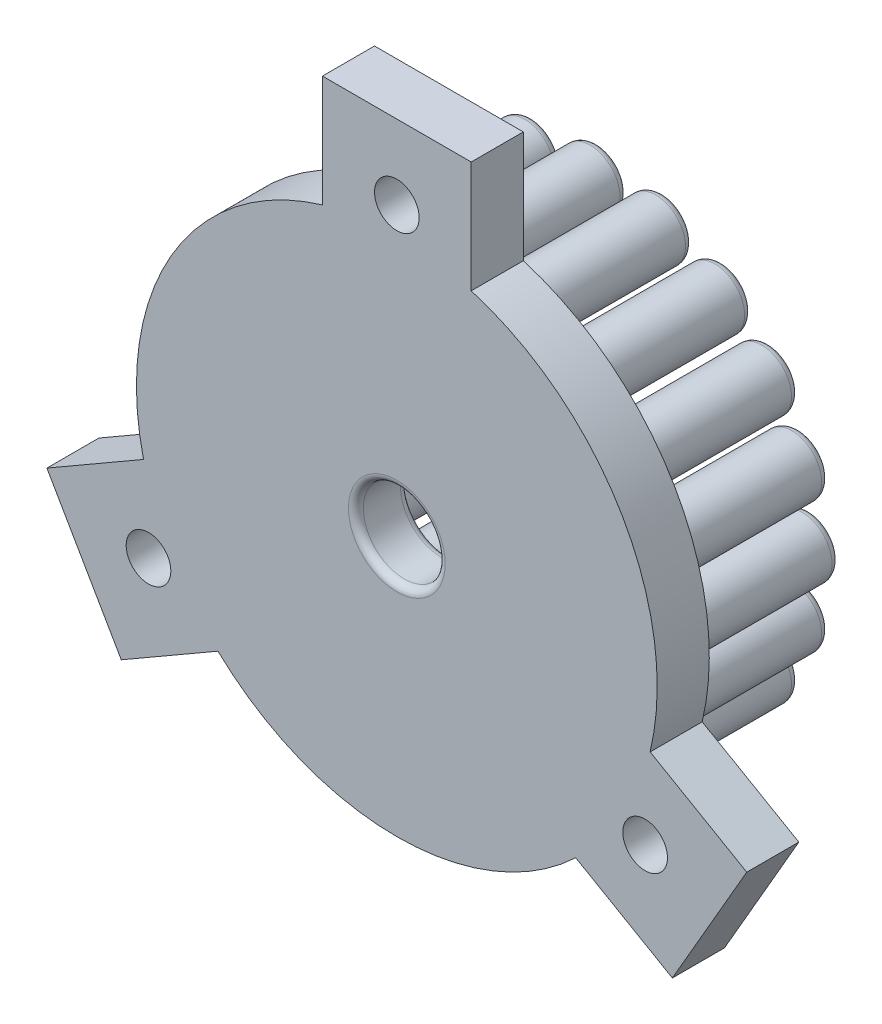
ISO-10303-21;
HEADER;
FILE_DESCRIPTION(('STEP AP214'),'2;1');
FILE_NAME('part.step','',(''),(''),'','','');
FILE_SCHEMA(('AUTOMOTIVE_DESIGN { 1 0 10303 214 1 1 1 1 }'));
ENDSEC;
DATA;
#1=APPLICATION_CONTEXT('core data for automotive mechanical design processes');
#2=APPLICATION_PROTOCOL_DEFINITION('international standard','automotive_design',2000,#1);
#3=PRODUCT_CONTEXT('',#1,'mechanical');
#4=PRODUCT('Part','Part','',(#3));
#5=PRODUCT_RELATED_PRODUCT_CATEGORY('part','',(#4));
#6=PRODUCT_DEFINITION_FORMATION('','',#4);
#7=PRODUCT_DEFINITION_CONTEXT('part definition',#1,'design');
#8=PRODUCT_DEFINITION('design','',#6,#7);
#9=PRODUCT_DEFINITION_SHAPE('','',#8);
#10=(LENGTH_UNIT() NAMED_UNIT(*) SI_UNIT(.MILLI.,.METRE.));
#11=(NAMED_UNIT(*) PLANE_ANGLE_UNIT() SI_UNIT($,.RADIAN.));
#12=(NAMED_UNIT(*) SI_UNIT($,.STERADIAN.) SOLID_ANGLE_UNIT());
#13=UNCERTAINTY_MEASURE_WITH_UNIT(LENGTH_MEASURE(1.E-05),#10,'distance_accuracy_value','');
#14=(GEOMETRIC_REPRESENTATION_CONTEXT(3) GLOBAL_UNCERTAINTY_ASSIGNED_CONTEXT((#13)) GLOBAL_UNIT_ASSIGNED_CONTEXT((#10,
#11,#12)) REPRESENTATION_CONTEXT('',''));
#15=CARTESIAN_POINT('',(0.,0.,0.));
#16=DIRECTION('',(0.,0.,1.));
#17=DIRECTION('',(1.,0.,0.));
#18=AXIS2_PLACEMENT_3D('',#15,#16,#17);
#19=CARTESIAN_POINT('',(0.,0.,27.));
#20=DIRECTION('',(0.,0.,-1.));
#21=DIRECTION('',(-1.,0.,0.));
#22=AXIS2_PLACEMENT_3D('',#19,#20,#21);
#23=CYLINDRICAL_SURFACE('',#22,35.);
#24=CARTESIAN_POINT('',(0.,0.,27.));
#25=DIRECTION('',(0.,0.,1.));
#26=DIRECTION('',(1.,0.,0.));
#27=AXIS2_PLACEMENT_3D('',#24,#25,#26);
#28=CIRCLE('',#27,35.);
#29=CARTESIAN_POINT('',(-24.0473750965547,-25.4307638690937,27.));
#30=VERTEX_POINT('',#29);
#31=CARTESIAN_POINT('',(24.0473750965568,-25.4307638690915,27.));
#32=VERTEX_POINT('',#31);
#33=EDGE_CURVE('E315',#30,#32,#28,.T.);
#34=ORIENTED_EDGE('',*,*,#33,.F.);
#35=DIRECTION('',(0.,0.,1.));
#36=VECTOR('',#35,1.);
#37=CARTESIAN_POINT('',(-24.0473750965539,-25.4307638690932,20.));
#38=LINE('',#37,#36);
#39=CARTESIAN_POINT('',(-24.0473750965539,-25.4307638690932,20.));
#40=VERTEX_POINT('',#39);
#41=EDGE_CURVE('E215',#40,#30,#38,.T.);
#42=ORIENTED_EDGE('',*,*,#41,.F.);
#43=CARTESIAN_POINT('',(0.,0.,20.));
#44=DIRECTION('',(0.,0.,1.));
#45=DIRECTION('',(1.,0.,0.));
#46=AXIS2_PLACEMENT_3D('',#43,#44,#45);
#47=CIRCLE('',#46,35.);
#48=CARTESIAN_POINT('',(24.0473750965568,-25.4307638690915,20.));
#49=VERTEX_POINT('',#48);
#50=EDGE_CURVE('E321',#40,#49,#47,.T.);
#51=ORIENTED_EDGE('',*,*,#50,.T.);
#52=DIRECTION('',(0.,0.,1.));
#53=VECTOR('',#52,1.);
#54=CARTESIAN_POINT('',(24.0473750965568,-25.4307638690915,20.));
#55=LINE('',#54,#53);
#56=EDGE_CURVE('E242',#49,#32,#55,.T.);
#57=ORIENTED_EDGE('',*,*,#56,.T.);
#58=EDGE_LOOP('',(#34,#42,#51,#57));
#59=FACE_BOUND('',#58,.T.);
#60=ADVANCED_FACE('F114',(#59),#23,.T.);
#61=CARTESIAN_POINT('',(34.047375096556,-8.11025579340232,27.));
#62=VERTEX_POINT('',#61);
#63=CARTESIAN_POINT('',(10.,33.5410196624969,27.));
#64=VERTEX_POINT('',#63);
#65=EDGE_CURVE('E316',#62,#64,#28,.T.);
#66=ORIENTED_EDGE('',*,*,#65,.F.);
#67=DIRECTION('',(0.,0.,1.));
#68=VECTOR('',#67,1.);
#69=CARTESIAN_POINT('',(34.0473750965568,-8.11025579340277,20.));
#70=LINE('',#69,#68);
#71=CARTESIAN_POINT('',(34.0473750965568,-8.11025579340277,20.));
#72=VERTEX_POINT('',#71);
#73=EDGE_CURVE('E235',#72,#62,#70,.T.);
#74=ORIENTED_EDGE('',*,*,#73,.F.);
#75=CARTESIAN_POINT('',(10.,33.5410196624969,20.));
#76=VERTEX_POINT('',#75);
#77=EDGE_CURVE('E300',#72,#76,#47,.T.);
#78=ORIENTED_EDGE('',*,*,#77,.T.);
#79=DIRECTION('',(0.,0.,1.));
#80=VECTOR('',#79,1.);
#81=CARTESIAN_POINT('',(10.,33.5410196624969,20.));
#82=LINE('',#81,#80);
#83=EDGE_CURVE('E304',#76,#64,#82,.T.);
#84=ORIENTED_EDGE('',*,*,#83,.T.);
#85=EDGE_LOOP('',(#66,#74,#78,#84));
#86=FACE_BOUND('',#85,.T.);
#87=ADVANCED_FACE('F585',(#86),#23,.T.);
#88=CARTESIAN_POINT('',(27.1051107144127,8.80698433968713,20.));
#89=DIRECTION('',(0.,0.,-1.));
#90=DIRECTION('',(-1.,0.,0.));
#91=AXIS2_PLACEMENT_3D('',#88,#89,#90);
#92=CYLINDRICAL_SURFACE('',#91,4.00000000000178);
#93=CARTESIAN_POINT('',(27.1051107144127,8.80698433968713,1.));
#94=DIRECTION('',(0.,0.,1.));
#95=DIRECTION('',(1.,0.,0.));
#96=AXIS2_PLACEMENT_3D('',#93,#94,#95);
#97=CIRCLE('',#96,4.00000000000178);
#98=CARTESIAN_POINT('',(31.1051107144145,8.80698433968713,1.));
#99=VERTEX_POINT('',#98);
#100=EDGE_CURVE('E417',#99,#99,#97,.T.);
#101=ORIENTED_EDGE('',*,*,#100,.T.);
#102=EDGE_LOOP('',(#101));
#103=FACE_BOUND('',#102,.T.);
#104=CARTESIAN_POINT('',(27.1051107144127,8.80698433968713,20.));
#105=DIRECTION('',(0.,0.,1.));
#106=DIRECTION('',(1.,0.,0.));
#107=AXIS2_PLACEMENT_3D('',#104,#105,#106);
#108=CIRCLE('',#107,4.00000000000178);
#109=CARTESIAN_POINT('',(31.1051107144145,8.80698433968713,20.));
#110=VERTEX_POINT('',#109);
#111=EDGE_CURVE('E314',#110,#110,#108,.T.);
#112=ORIENTED_EDGE('',*,*,#111,.F.);
#113=EDGE_LOOP('',(#112));
#114=FACE_BOUND('',#113,.T.);
#115=ADVANCED_FACE('F592',(#103,#114),#92,.T.);
#116=CARTESIAN_POINT('',(27.1051107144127,8.80698433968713,0.));
#117=DIRECTION('',(0.,0.,1.));
#118=DIRECTION('',(1.,0.,0.));
#119=AXIS2_PLACEMENT_3D('',#116,#117,#118);
#120=PLANE('',#119);
#121=CARTESIAN_POINT('',(27.1051107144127,8.80698433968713,0.));
#122=DIRECTION('',(0.,0.,1.));
#123=DIRECTION('',(1.,0.,0.));
#124=AXIS2_PLACEMENT_3D('',#121,#122,#123);
#125=CIRCLE('',#124,3.00000000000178);
#126=CARTESIAN_POINT('',(30.1051107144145,8.80698433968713,0.));
#127=VERTEX_POINT('',#126);
#128=EDGE_CURVE('E421',#127,#127,#125,.F.);
#129=ORIENTED_EDGE('',*,*,#128,.T.);
#130=EDGE_LOOP('',(#129));
#131=FACE_BOUND('',#130,.T.);
#132=ADVANCED_FACE('F597',(#131),#120,.F.);
#133=CARTESIAN_POINT('',(-10.,33.5410196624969,20.));
#134=VERTEX_POINT('',#133);
#135=CARTESIAN_POINT('',(-34.0473750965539,-8.11025579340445,20.));
#136=VERTEX_POINT('',#135);
#137=EDGE_CURVE('E317',#134,#136,#47,.T.);
#138=ORIENTED_EDGE('',*,*,#137,.T.);
#139=DIRECTION('',(0.,0.,1.));
#140=VECTOR('',#139,1.);
#141=CARTESIAN_POINT('',(-34.0473750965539,-8.11025579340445,20.));
#142=LINE('',#141,#140);
#143=CARTESIAN_POINT('',(-34.0473750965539,-8.11025579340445,27.));
#144=VERTEX_POINT('',#143);
#145=EDGE_CURVE('E239',#136,#144,#142,.T.);
#146=ORIENTED_EDGE('',*,*,#145,.T.);
#147=CARTESIAN_POINT('',(-10.,33.5410196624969,27.));
#148=VERTEX_POINT('',#147);
#149=EDGE_CURVE('E311',#148,#144,#28,.T.);
#150=ORIENTED_EDGE('',*,*,#149,.F.);
#151=DIRECTION('',(0.,0.,1.));
#152=VECTOR('',#151,1.);
#153=CARTESIAN_POINT('',(-10.,33.5410196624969,20.));
#154=LINE('',#153,#152);
#155=EDGE_CURVE('E287',#134,#148,#154,.T.);
#156=ORIENTED_EDGE('',*,*,#155,.F.);
#157=EDGE_LOOP('',(#138,#146,#150,#156));
#158=FACE_BOUND('',#157,.T.);
#159=ADVANCED_FACE('F588',(#158),#23,.T.);
#160=CARTESIAN_POINT('',(0.,0.,27.));
#161=DIRECTION('',(0.,0.,1.));
#162=DIRECTION('',(1.,0.,0.));
#163=AXIS2_PLACEMENT_3D('',#160,#161,#162);
#164=PLANE('',#163);
#165=CARTESIAN_POINT('',(0.,0.,27.));
#166=DIRECTION('',(0.,0.,1.));
#167=DIRECTION('',(1.,0.,0.));
#168=AXIS2_PLACEMENT_3D('',#165,#166,#167);
#169=CIRCLE('',#168,6.5);
#170=CARTESIAN_POINT('',(6.5,0.,27.));
#171=VERTEX_POINT('',#170);
#172=EDGE_CURVE('E413',#171,#171,#169,.F.);
#173=ORIENTED_EDGE('',*,*,#172,.T.);
#174=EDGE_LOOP('',(#173));
#175=FACE_BOUND('',#174,.T.);
#176=CARTESIAN_POINT('',(0.,38.5410196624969,27.));
#177=DIRECTION('',(0.,0.,1.));
#178=DIRECTION('',(1.,0.,0.));
#179=AXIS2_PLACEMENT_3D('',#176,#177,#178);
#180=CIRCLE('',#179,3.);
#181=CARTESIAN_POINT('',(3.,38.5410196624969,27.));
#182=VERTEX_POINT('',#181);
#183=EDGE_CURVE('E636',#182,#182,#180,.T.);
#184=ORIENTED_EDGE('',*,*,#183,.F.);
#185=EDGE_LOOP('',(#184));
#186=FACE_BOUND('',#185,.T.);
#187=CARTESIAN_POINT('',(33.3775021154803,-19.270509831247,27.));
#188=DIRECTION('',(0.,0.,1.));
#189=DIRECTION('',(1.,0.,0.));
#190=AXIS2_PLACEMENT_3D('',#187,#188,#189);
#191=CIRCLE('',#190,3.00000000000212);
#192=CARTESIAN_POINT('',(36.3775021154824,-19.270509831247,27.));
#193=VERTEX_POINT('',#192);
#194=EDGE_CURVE('E632',#193,#193,#191,.T.);
#195=ORIENTED_EDGE('',*,*,#194,.F.);
#196=EDGE_LOOP('',(#195));
#197=FACE_BOUND('',#196,.T.);
#198=CARTESIAN_POINT('',(-33.3775021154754,-19.2705098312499,27.));
#199=DIRECTION('',(0.,0.,1.));
#200=DIRECTION('',(1.,0.,0.));
#201=AXIS2_PLACEMENT_3D('',#198,#199,#200);
#202=CIRCLE('',#201,3.00000000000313);
#203=CARTESIAN_POINT('',(-30.3775021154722,-19.2705098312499,27.));
#204=VERTEX_POINT('',#203);
#205=EDGE_CURVE('E623',#204,#204,#202,.T.);
#206=ORIENTED_EDGE('',*,*,#205,.F.);
#207=EDGE_LOOP('',(#206));
#208=FACE_BOUND('',#207,.T.);
#209=ORIENTED_EDGE('',*,*,#149,.T.);
#210=DIRECTION('',(-0.866025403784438,-0.5,0.));
#211=VECTOR('',#210,1.);
#212=CARTESIAN_POINT('',(-34.0473750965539,-8.11025579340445,27.));
#213=LINE('',#212,#211);
#214=CARTESIAN_POINT('',(-47.0377561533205,-15.6102557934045,27.));
#215=VERTEX_POINT('',#214);
#216=EDGE_CURVE('E219',#144,#215,#213,.T.);
#217=ORIENTED_EDGE('',*,*,#216,.T.);
#218=DIRECTION('',(0.5,-0.866025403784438,0.));
#219=VECTOR('',#218,1.);
#220=CARTESIAN_POINT('',(-37.0377561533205,-32.9307638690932,27.));
#221=LINE('',#220,#219);
#222=CARTESIAN_POINT('',(-37.0377561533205,-32.9307638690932,27.));
#223=VERTEX_POINT('',#222);
#224=EDGE_CURVE('E207',#215,#223,#221,.T.);
#225=ORIENTED_EDGE('',*,*,#224,.T.);
#226=DIRECTION('',(0.866025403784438,0.5,0.));
#227=VECTOR('',#226,1.);
#228=CARTESIAN_POINT('',(-24.0473750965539,-25.4307638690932,27.));
#229=LINE('',#228,#227);
#230=EDGE_CURVE('E130',#223,#30,#229,.T.);
#231=ORIENTED_EDGE('',*,*,#230,.T.);
#232=ORIENTED_EDGE('',*,*,#33,.T.);
#233=DIRECTION('',(0.866025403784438,-0.5,0.));
#234=VECTOR('',#233,1.);
#235=CARTESIAN_POINT('',(24.0473750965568,-25.4307638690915,27.));
#236=LINE('',#235,#234);
#237=CARTESIAN_POINT('',(37.0377561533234,-32.9307638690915,27.));
#238=VERTEX_POINT('',#237);
#239=EDGE_CURVE('E261',#32,#238,#236,.T.);
#240=ORIENTED_EDGE('',*,*,#239,.T.);
#241=DIRECTION('',(0.5,0.866025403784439,0.));
#242=VECTOR('',#241,1.);
#243=CARTESIAN_POINT('',(47.0377561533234,-15.6102557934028,27.));
#244=LINE('',#243,#242);
#245=CARTESIAN_POINT('',(47.0377561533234,-15.6102557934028,27.));
#246=VERTEX_POINT('',#245);
#247=EDGE_CURVE('E257',#238,#246,#244,.T.);
#248=ORIENTED_EDGE('',*,*,#247,.T.);
#249=DIRECTION('',(-0.866025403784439,0.5,0.));
#250=VECTOR('',#249,1.);
#251=CARTESIAN_POINT('',(34.0473750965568,-8.11025579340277,27.));
#252=LINE('',#251,#250);
#253=EDGE_CURVE('E137',#246,#62,#252,.T.);
#254=ORIENTED_EDGE('',*,*,#253,.T.);
#255=ORIENTED_EDGE('',*,*,#65,.T.);
#256=DIRECTION('',(0.,1.,0.));
#257=VECTOR('',#256,1.);
#258=CARTESIAN_POINT('',(10.,33.5410196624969,27.));
#259=LINE('',#258,#257);
#260=CARTESIAN_POINT('',(10.,48.5410196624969,27.));
#261=VERTEX_POINT('',#260);
#262=EDGE_CURVE('E290',#64,#261,#259,.T.);
#263=ORIENTED_EDGE('',*,*,#262,.T.);
#264=DIRECTION('',(-1.,0.,0.));
#265=VECTOR('',#264,1.);
#266=CARTESIAN_POINT('',(-10.,48.5410196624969,27.));
#267=LINE('',#266,#265);
#268=CARTESIAN_POINT('',(-10.,48.5410196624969,27.));
#269=VERTEX_POINT('',#268);
#270=EDGE_CURVE('E279',#261,#269,#267,.T.);
#271=ORIENTED_EDGE('',*,*,#270,.T.);
#272=DIRECTION('',(0.,-1.,0.));
#273=VECTOR('',#272,1.);
#274=CARTESIAN_POINT('',(-10.,33.5410196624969,27.));
#275=LINE('',#274,#273);
#276=EDGE_CURVE('E265',#269,#148,#275,.T.);
#277=ORIENTED_EDGE('',*,*,#276,.T.);
#278=EDGE_LOOP('',(#209,#217,#225,#231,#232,#240,#248,#254,#255,#263,#271,#277));
#279=FACE_BOUND('',#278,.T.);
#280=ADVANCED_FACE('F218',(#175,#186,#197,#208,#279),#164,.T.);
#281=CARTESIAN_POINT('',(0.,0.,20.));
#282=DIRECTION('',(0.,0.,1.));
#283=DIRECTION('',(1.,0.,0.));
#284=AXIS2_PLACEMENT_3D('',#281,#282,#283);
#285=PLANE('',#284);
#286=CARTESIAN_POINT('',(0.,0.,20.));
#287=DIRECTION('',(0.,0.,1.));
#288=DIRECTION('',(1.,0.,0.));
#289=AXIS2_PLACEMENT_3D('',#286,#287,#288);
#290=CIRCLE('',#289,6.5);
#291=CARTESIAN_POINT('',(6.5,0.,20.));
#292=VERTEX_POINT('',#291);
#293=EDGE_CURVE('E401',#292,#292,#290,.T.);
#294=ORIENTED_EDGE('',*,*,#293,.T.);
#295=EDGE_LOOP('',(#294));
#296=FACE_BOUND('',#295,.T.);
#297=CARTESIAN_POINT('',(0.,38.5410196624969,20.));
#298=DIRECTION('',(0.,0.,1.));
#299=DIRECTION('',(1.,0.,0.));
#300=AXIS2_PLACEMENT_3D('',#297,#298,#299);
#301=CIRCLE('',#300,3.);
#302=CARTESIAN_POINT('',(3.,38.5410196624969,20.));
#303=VERTEX_POINT('',#302);
#304=EDGE_CURVE('E640',#303,#303,#301,.F.);
#305=ORIENTED_EDGE('',*,*,#304,.F.);
#306=EDGE_LOOP('',(#305));
#307=FACE_BOUND('',#306,.T.);
#308=CARTESIAN_POINT('',(33.3775021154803,-19.270509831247,20.));
#309=DIRECTION('',(0.,0.,1.));
#310=DIRECTION('',(1.,0.,0.));
#311=AXIS2_PLACEMENT_3D('',#308,#309,#310);
#312=CIRCLE('',#311,3.00000000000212);
#313=CARTESIAN_POINT('',(36.3775021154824,-19.270509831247,20.));
#314=VERTEX_POINT('',#313);
#315=EDGE_CURVE('E627',#314,#314,#312,.F.);
#316=ORIENTED_EDGE('',*,*,#315,.F.);
#317=EDGE_LOOP('',(#316));
#318=FACE_BOUND('',#317,.T.);
#319=CARTESIAN_POINT('',(-33.3775021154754,-19.2705098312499,20.));
#320=DIRECTION('',(0.,0.,1.));
#321=DIRECTION('',(1.,0.,0.));
#322=AXIS2_PLACEMENT_3D('',#319,#320,#321);
#323=CIRCLE('',#322,3.00000000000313);
#324=CARTESIAN_POINT('',(-30.3775021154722,-19.2705098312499,20.));
#325=VERTEX_POINT('',#324);
#326=EDGE_CURVE('E628',#325,#325,#323,.F.);
#327=ORIENTED_EDGE('',*,*,#326,.F.);
#328=EDGE_LOOP('',(#327));
#329=FACE_BOUND('',#328,.T.);
#330=CARTESIAN_POINT('',(-8.80698433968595,27.1051107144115,20.));
#331=DIRECTION('',(0.,0.,1.));
#332=DIRECTION('',(1.,0.,0.));
#333=AXIS2_PLACEMENT_3D('',#330,#331,#332);
#334=CIRCLE('',#333,4.00000000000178);
#335=CARTESIAN_POINT('',(-4.80698433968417,27.1051107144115,20.));
#336=VERTEX_POINT('',#335);
#337=EDGE_CURVE('E397',#336,#336,#334,.F.);
#338=ORIENTED_EDGE('',*,*,#337,.F.);
#339=EDGE_LOOP('',(#338));
#340=FACE_BOUND('',#339,.T.);
#341=CARTESIAN_POINT('',(-16.7518796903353,23.0569843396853,20.));
#342=DIRECTION('',(0.,0.,1.));
#343=DIRECTION('',(1.,0.,0.));
#344=AXIS2_PLACEMENT_3D('',#341,#342,#343);
#345=CIRCLE('',#344,4.00000000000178);
#346=CARTESIAN_POINT('',(-12.7518796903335,23.0569843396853,20.));
#347=VERTEX_POINT('',#346);
#348=EDGE_CURVE('E393',#347,#347,#345,.F.);
#349=ORIENTED_EDGE('',*,*,#348,.F.);
#350=EDGE_LOOP('',(#349));
#351=FACE_BOUND('',#350,.T.);
#352=CARTESIAN_POINT('',(-23.0569843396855,16.7518796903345,20.));
#353=DIRECTION('',(0.,0.,1.));
#354=DIRECTION('',(1.,0.,0.));
#355=AXIS2_PLACEMENT_3D('',#352,#353,#354);
#356=CIRCLE('',#355,4.00000000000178);
#357=CARTESIAN_POINT('',(-19.0569843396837,16.7518796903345,20.));
#358=VERTEX_POINT('',#357);
#359=EDGE_CURVE('E389',#358,#358,#356,.F.);
#360=ORIENTED_EDGE('',*,*,#359,.F.);
#361=EDGE_LOOP('',(#360));
#362=FACE_BOUND('',#361,.T.);
#363=CARTESIAN_POINT('',(-27.1051107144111,8.80698433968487,20.));
#364=DIRECTION('',(0.,0.,1.));
#365=DIRECTION('',(1.,0.,0.));
#366=AXIS2_PLACEMENT_3D('',#363,#364,#365);
#367=CIRCLE('',#366,4.00000000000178);
#368=CARTESIAN_POINT('',(-23.1051107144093,8.80698433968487,20.));
#369=VERTEX_POINT('',#368);
#370=EDGE_CURVE('E385',#369,#369,#367,.F.);
#371=ORIENTED_EDGE('',*,*,#370,.F.);
#372=EDGE_LOOP('',(#371));
#373=FACE_BOUND('',#372,.T.);
#374=CARTESIAN_POINT('',(-28.4999999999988,-1.1920891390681E-12,20.));
#375=DIRECTION('',(0.,0.,1.));
#376=DIRECTION('',(1.,0.,0.));
#377=AXIS2_PLACEMENT_3D('',#374,#375,#376);
#378=CIRCLE('',#377,4.00000000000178);
#379=CARTESIAN_POINT('',(-24.499999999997,-1.1920891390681E-12,20.));
#380=VERTEX_POINT('',#379);
#381=EDGE_CURVE('E381',#380,#380,#378,.F.);
#382=ORIENTED_EDGE('',*,*,#381,.F.);
#383=EDGE_LOOP('',(#382));
#384=FACE_BOUND('',#383,.T.);
#385=CARTESIAN_POINT('',(-27.1051107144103,-8.80698433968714,20.));
#386=DIRECTION('',(0.,0.,1.));
#387=DIRECTION('',(1.,0.,0.));
#388=AXIS2_PLACEMENT_3D('',#385,#386,#387);
#389=CIRCLE('',#388,4.00000000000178);
#390=CARTESIAN_POINT('',(-23.1051107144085,-8.80698433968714,20.));
#391=VERTEX_POINT('',#390);
#392=EDGE_CURVE('E377',#391,#391,#389,.F.);
#393=ORIENTED_EDGE('',*,*,#392,.F.);
#394=EDGE_LOOP('',(#393));
#395=FACE_BOUND('',#394,.T.);
#396=CARTESIAN_POINT('',(-23.0569843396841,-16.7518796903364,20.));
#397=DIRECTION('',(0.,0.,1.));
#398=DIRECTION('',(1.,0.,0.));
#399=AXIS2_PLACEMENT_3D('',#396,#397,#398);
#400=CIRCLE('',#399,4.00000000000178);
#401=CARTESIAN_POINT('',(-19.0569843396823,-16.7518796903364,20.));
#402=VERTEX_POINT('',#401);
#403=EDGE_CURVE('E373',#402,#402,#400,.F.);
#404=ORIENTED_EDGE('',*,*,#403,.F.);
#405=EDGE_LOOP('',(#404));
#406=FACE_BOUND('',#405,.T.);
#407=CARTESIAN_POINT('',(28.5000000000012,1.18859889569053E-12,20.));
#408=DIRECTION('',(0.,0.,1.));
#409=DIRECTION('',(1.,0.,0.));
#410=AXIS2_PLACEMENT_3D('',#407,#408,#409);
#411=CIRCLE('',#410,4.00000000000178);
#412=CARTESIAN_POINT('',(32.500000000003,1.18859889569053E-12,20.));
#413=VERTEX_POINT('',#412);
#414=EDGE_CURVE('E369',#413,#413,#411,.F.);
#415=ORIENTED_EDGE('',*,*,#414,.F.);
#416=EDGE_LOOP('',(#415));
#417=FACE_BOUND('',#416,.T.);
#418=CARTESIAN_POINT('',(27.1051107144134,-8.80698433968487,20.));
#419=DIRECTION('',(0.,0.,1.));
#420=DIRECTION('',(1.,0.,0.));
#421=AXIS2_PLACEMENT_3D('',#418,#419,#420);
#422=CIRCLE('',#421,4.00000000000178);
#423=CARTESIAN_POINT('',(31.1051107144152,-8.80698433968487,20.));
#424=VERTEX_POINT('',#423);
#425=EDGE_CURVE('E365',#424,#424,#422,.F.);
#426=ORIENTED_EDGE('',*,*,#425,.F.);
#427=EDGE_LOOP('',(#426));
#428=FACE_BOUND('',#427,.T.);
#429=CARTESIAN_POINT('',(23.0569843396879,-16.7518796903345,20.));
#430=DIRECTION('',(0.,0.,1.));
#431=DIRECTION('',(1.,0.,0.));
#432=AXIS2_PLACEMENT_3D('',#429,#430,#431);
#433=CIRCLE('',#432,4.00000000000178);
#434=CARTESIAN_POINT('',(27.0569843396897,-16.7518796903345,20.));
#435=VERTEX_POINT('',#434);
#436=EDGE_CURVE('E361',#435,#435,#433,.F.);
#437=ORIENTED_EDGE('',*,*,#436,.F.);
#438=EDGE_LOOP('',(#437));
#439=FACE_BOUND('',#438,.T.);
#440=CARTESIAN_POINT('',(16.7518796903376,-23.0569843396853,20.));
#441=DIRECTION('',(0.,0.,1.));
#442=DIRECTION('',(1.,0.,0.));
#443=AXIS2_PLACEMENT_3D('',#440,#441,#442);
#444=CIRCLE('',#443,4.00000000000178);
#445=CARTESIAN_POINT('',(20.7518796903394,-23.0569843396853,20.));
#446=VERTEX_POINT('',#445);
#447=EDGE_CURVE('E357',#446,#446,#444,.F.);
#448=ORIENTED_EDGE('',*,*,#447,.F.);
#449=EDGE_LOOP('',(#448));
#450=FACE_BOUND('',#449,.T.);
#451=CARTESIAN_POINT('',(8.80698433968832,-27.1051107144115,20.));
#452=DIRECTION('',(0.,0.,1.));
#453=DIRECTION('',(1.,0.,0.));
#454=AXIS2_PLACEMENT_3D('',#451,#452,#453);
#455=CIRCLE('',#454,4.00000000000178);
#456=CARTESIAN_POINT('',(12.8069843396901,-27.1051107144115,20.));
#457=VERTEX_POINT('',#456);
#458=EDGE_CURVE('E353',#457,#457,#455,.F.);
#459=ORIENTED_EDGE('',*,*,#458,.F.);
#460=EDGE_LOOP('',(#459));
#461=FACE_BOUND('',#460,.T.);
#462=CARTESIAN_POINT('',(2.37719779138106E-12,-28.5,20.));
#463=DIRECTION('',(0.,0.,1.));
#464=DIRECTION('',(1.,0.,0.));
#465=AXIS2_PLACEMENT_3D('',#462,#463,#464);
#466=CIRCLE('',#465,4.00000000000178);
#467=CARTESIAN_POINT('',(4.00000000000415,-28.5,20.));
#468=VERTEX_POINT('',#467);
#469=EDGE_CURVE('E349',#468,#468,#466,.F.);
#470=ORIENTED_EDGE('',*,*,#469,.F.);
#471=EDGE_LOOP('',(#470));
#472=FACE_BOUND('',#471,.T.);
#473=CARTESIAN_POINT('',(-8.80698433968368,-27.1051107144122,20.));
#474=DIRECTION('',(0.,0.,1.));
#475=DIRECTION('',(1.,0.,0.));
#476=AXIS2_PLACEMENT_3D('',#473,#474,#475);
#477=CIRCLE('',#476,4.00000000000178);
#478=CARTESIAN_POINT('',(-4.80698433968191,-27.1051107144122,20.));
#479=VERTEX_POINT('',#478);
#480=EDGE_CURVE('E345',#479,#479,#477,.F.);
#481=ORIENTED_EDGE('',*,*,#480,.F.);
#482=EDGE_LOOP('',(#481));
#483=FACE_BOUND('',#482,.T.);
#484=CARTESIAN_POINT('',(-16.7518796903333,-23.0569843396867,20.));
#485=DIRECTION('',(0.,0.,1.));
#486=DIRECTION('',(1.,0.,0.));
#487=AXIS2_PLACEMENT_3D('',#484,#485,#486);
#488=CIRCLE('',#487,4.00000000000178);
#489=CARTESIAN_POINT('',(-12.7518796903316,-23.0569843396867,20.));
#490=VERTEX_POINT('',#489);
#491=EDGE_CURVE('E341',#490,#490,#488,.F.);
#492=ORIENTED_EDGE('',*,*,#491,.F.);
#493=EDGE_LOOP('',(#492));
#494=FACE_BOUND('',#493,.T.);
#495=CARTESIAN_POINT('',(0.,28.5,20.));
#496=DIRECTION('',(0.,0.,1.));
#497=DIRECTION('',(1.,0.,0.));
#498=AXIS2_PLACEMENT_3D('',#495,#496,#497);
#499=CIRCLE('',#498,4.00000000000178);
#500=CARTESIAN_POINT('',(4.00000000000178,28.5,20.));
#501=VERTEX_POINT('',#500);
#502=EDGE_CURVE('E337',#501,#501,#499,.F.);
#503=ORIENTED_EDGE('',*,*,#502,.F.);
#504=EDGE_LOOP('',(#503));
#505=FACE_BOUND('',#504,.T.);
#506=CARTESIAN_POINT('',(8.80698433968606,27.1051107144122,20.));
#507=DIRECTION('',(0.,0.,1.));
#508=DIRECTION('',(1.,0.,0.));
#509=AXIS2_PLACEMENT_3D('',#506,#507,#508);
#510=CIRCLE('',#509,4.00000000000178);
#511=CARTESIAN_POINT('',(12.8069843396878,27.1051107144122,20.));
#512=VERTEX_POINT('',#511);
#513=EDGE_CURVE('E333',#512,#512,#510,.F.);
#514=ORIENTED_EDGE('',*,*,#513,.F.);
#515=EDGE_LOOP('',(#514));
#516=FACE_BOUND('',#515,.T.);
#517=CARTESIAN_POINT('',(16.7518796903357,23.0569843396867,20.));
#518=DIRECTION('',(0.,0.,1.));
#519=DIRECTION('',(1.,0.,0.));
#520=AXIS2_PLACEMENT_3D('',#517,#518,#519);
#521=CIRCLE('',#520,4.00000000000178);
#522=CARTESIAN_POINT('',(20.7518796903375,23.0569843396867,20.));
#523=VERTEX_POINT('',#522);
#524=EDGE_CURVE('E329',#523,#523,#521,.F.);
#525=ORIENTED_EDGE('',*,*,#524,.F.);
#526=EDGE_LOOP('',(#525));
#527=FACE_BOUND('',#526,.T.);
#528=CARTESIAN_POINT('',(23.0569843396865,16.7518796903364,20.));
#529=DIRECTION('',(0.,0.,1.));
#530=DIRECTION('',(1.,0.,0.));
#531=AXIS2_PLACEMENT_3D('',#528,#529,#530);
#532=CIRCLE('',#531,4.00000000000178);
#533=CARTESIAN_POINT('',(27.0569843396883,16.7518796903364,20.));
#534=VERTEX_POINT('',#533);
#535=EDGE_CURVE('E325',#534,#534,#532,.F.);
#536=ORIENTED_EDGE('',*,*,#535,.F.);
#537=EDGE_LOOP('',(#536));
#538=FACE_BOUND('',#537,.T.);
#539=ORIENTED_EDGE('',*,*,#111,.T.);
#540=EDGE_LOOP('',(#539));
#541=FACE_BOUND('',#540,.T.);
#542=ORIENTED_EDGE('',*,*,#50,.F.);
#543=DIRECTION('',(0.866025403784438,0.5,0.));
#544=VECTOR('',#543,1.);
#545=CARTESIAN_POINT('',(-24.0473750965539,-25.4307638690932,20.));
#546=LINE('',#545,#544);
#547=CARTESIAN_POINT('',(-37.0377561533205,-32.9307638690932,20.));
#548=VERTEX_POINT('',#547);
#549=EDGE_CURVE('E236',#548,#40,#546,.T.);
#550=ORIENTED_EDGE('',*,*,#549,.F.);
#551=DIRECTION('',(0.5,-0.866025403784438,0.));
#552=VECTOR('',#551,1.);
#553=CARTESIAN_POINT('',(-37.0377561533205,-32.9307638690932,20.));
#554=LINE('',#553,#552);
#555=CARTESIAN_POINT('',(-47.0377561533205,-15.6102557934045,20.));
#556=VERTEX_POINT('',#555);
#557=EDGE_CURVE('E210',#556,#548,#554,.T.);
#558=ORIENTED_EDGE('',*,*,#557,.F.);
#559=DIRECTION('',(-0.866025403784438,-0.5,0.));
#560=VECTOR('',#559,1.);
#561=CARTESIAN_POINT('',(-34.0473750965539,-8.11025579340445,20.));
#562=LINE('',#561,#560);
#563=EDGE_CURVE('E226',#136,#556,#562,.T.);
#564=ORIENTED_EDGE('',*,*,#563,.F.);
#565=ORIENTED_EDGE('',*,*,#137,.F.);
#566=DIRECTION('',(0.,-1.,0.));
#567=VECTOR('',#566,1.);
#568=CARTESIAN_POINT('',(-10.,33.5410196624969,20.));
#569=LINE('',#568,#567);
#570=CARTESIAN_POINT('',(-10.,48.5410196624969,20.));
#571=VERTEX_POINT('',#570);
#572=EDGE_CURVE('E275',#571,#134,#569,.T.);
#573=ORIENTED_EDGE('',*,*,#572,.F.);
#574=DIRECTION('',(-1.,0.,0.));
#575=VECTOR('',#574,1.);
#576=CARTESIAN_POINT('',(-10.,48.5410196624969,20.));
#577=LINE('',#576,#575);
#578=CARTESIAN_POINT('',(10.,48.5410196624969,20.));
#579=VERTEX_POINT('',#578);
#580=EDGE_CURVE('E283',#579,#571,#577,.T.);
#581=ORIENTED_EDGE('',*,*,#580,.F.);
#582=DIRECTION('',(0.,1.,0.));
#583=VECTOR('',#582,1.);
#584=CARTESIAN_POINT('',(10.,33.5410196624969,20.));
#585=LINE('',#584,#583);
#586=EDGE_CURVE('E278',#76,#579,#585,.T.);
#587=ORIENTED_EDGE('',*,*,#586,.F.);
#588=ORIENTED_EDGE('',*,*,#77,.F.);
#589=DIRECTION('',(-0.866025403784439,0.5,0.));
#590=VECTOR('',#589,1.);
#591=CARTESIAN_POINT('',(34.0473750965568,-8.11025579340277,20.));
#592=LINE('',#591,#590);
#593=CARTESIAN_POINT('',(47.0377561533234,-15.6102557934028,20.));
#594=VERTEX_POINT('',#593);
#595=EDGE_CURVE('E246',#594,#72,#592,.T.);
#596=ORIENTED_EDGE('',*,*,#595,.F.);
#597=DIRECTION('',(0.5,0.866025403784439,0.));
#598=VECTOR('',#597,1.);
#599=CARTESIAN_POINT('',(47.0377561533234,-15.6102557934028,20.));
#600=LINE('',#599,#598);
#601=CARTESIAN_POINT('',(37.0377561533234,-32.9307638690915,20.));
#602=VERTEX_POINT('',#601);
#603=EDGE_CURVE('E268',#602,#594,#600,.T.);
#604=ORIENTED_EDGE('',*,*,#603,.F.);
#605=DIRECTION('',(0.866025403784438,-0.5,0.));
#606=VECTOR('',#605,1.);
#607=CARTESIAN_POINT('',(24.0473750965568,-25.4307638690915,20.));
#608=LINE('',#607,#606);
#609=EDGE_CURVE('E258',#49,#602,#608,.T.);
#610=ORIENTED_EDGE('',*,*,#609,.F.);
#611=EDGE_LOOP('',(#542,#550,#558,#564,#565,#573,#581,#587,#588,#596,#604,#610));
#612=FACE_BOUND('',#611,.T.);
#613=ADVANCED_FACE('F603',(#296,#307,#318,#329,#340,#351,#362,#373,#384,#395,#406,#417,#428,
#439,#450,#461,#472,#483,#494,#505,#516,#527,#538,#541,#612),#285,.F.);
#614=CARTESIAN_POINT('',(23.0569843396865,16.7518796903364,20.));
#615=DIRECTION('',(0.,0.,-1.));
#616=DIRECTION('',(-1.,0.,0.));
#617=AXIS2_PLACEMENT_3D('',#614,#615,#616);
#618=CYLINDRICAL_SURFACE('',#617,4.00000000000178);
#619=CARTESIAN_POINT('',(23.0569843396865,16.7518796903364,1.));
#620=DIRECTION('',(0.,0.,1.));
#621=DIRECTION('',(1.,0.,0.));
#622=AXIS2_PLACEMENT_3D('',#619,#620,#621);
#623=CIRCLE('',#622,4.00000000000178);
#624=CARTESIAN_POINT('',(27.0569843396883,16.7518796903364,1.));
#625=VERTEX_POINT('',#624);
#626=EDGE_CURVE('E489',#625,#625,#623,.T.);
#627=ORIENTED_EDGE('',*,*,#626,.T.);
#628=EDGE_LOOP('',(#627));
#629=FACE_BOUND('',#628,.T.);
#630=ORIENTED_EDGE('',*,*,#535,.T.);
#631=EDGE_LOOP('',(#630));
#632=FACE_BOUND('',#631,.T.);
#633=ADVANCED_FACE('F665',(#629,#632),#618,.T.);
#634=CARTESIAN_POINT('',(23.0569843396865,16.7518796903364,0.));
#635=DIRECTION('',(0.,0.,1.));
#636=DIRECTION('',(1.,0.,0.));
#637=AXIS2_PLACEMENT_3D('',#634,#635,#636);
#638=PLANE('',#637);
#639=CARTESIAN_POINT('',(23.0569843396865,16.7518796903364,0.));
#640=DIRECTION('',(0.,0.,1.));
#641=DIRECTION('',(1.,0.,0.));
#642=AXIS2_PLACEMENT_3D('',#639,#640,#641);
#643=CIRCLE('',#642,3.00000000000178);
#644=CARTESIAN_POINT('',(26.0569843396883,16.7518796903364,0.));
#645=VERTEX_POINT('',#644);
#646=EDGE_CURVE('E493',#645,#645,#643,.F.);
#647=ORIENTED_EDGE('',*,*,#646,.T.);
#648=EDGE_LOOP('',(#647));
#649=FACE_BOUND('',#648,.T.);
#650=ADVANCED_FACE('F934',(#649),#638,.F.);
#651=CARTESIAN_POINT('',(16.7518796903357,23.0569843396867,20.));
#652=DIRECTION('',(0.,0.,-1.));
#653=DIRECTION('',(-1.,0.,0.));
#654=AXIS2_PLACEMENT_3D('',#651,#652,#653);
#655=CYLINDRICAL_SURFACE('',#654,4.00000000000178);
#656=CARTESIAN_POINT('',(16.7518796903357,23.0569843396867,1.));
#657=DIRECTION('',(0.,0.,1.));
#658=DIRECTION('',(1.,0.,0.));
#659=AXIS2_PLACEMENT_3D('',#656,#657,#658);
#660=CIRCLE('',#659,4.00000000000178);
#661=CARTESIAN_POINT('',(20.7518796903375,23.0569843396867,1.));
#662=VERTEX_POINT('',#661);
#663=EDGE_CURVE('E497',#662,#662,#660,.T.);
#664=ORIENTED_EDGE('',*,*,#663,.T.);
#665=EDGE_LOOP('',(#664));
#666=FACE_BOUND('',#665,.T.);
#667=ORIENTED_EDGE('',*,*,#524,.T.);
#668=EDGE_LOOP('',(#667));
#669=FACE_BOUND('',#668,.T.);
#670=ADVANCED_FACE('F931',(#666,#669),#655,.T.);
#671=CARTESIAN_POINT('',(16.7518796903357,23.0569843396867,0.));
#672=DIRECTION('',(0.,0.,1.));
#673=DIRECTION('',(1.,0.,0.));
#674=AXIS2_PLACEMENT_3D('',#671,#672,#673);
#675=PLANE('',#674);
#676=CARTESIAN_POINT('',(16.7518796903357,23.0569843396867,0.));
#677=DIRECTION('',(0.,0.,1.));
#678=DIRECTION('',(1.,0.,0.));
#679=AXIS2_PLACEMENT_3D('',#676,#677,#678);
#680=CIRCLE('',#679,3.00000000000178);
#681=CARTESIAN_POINT('',(19.7518796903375,23.0569843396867,0.));
#682=VERTEX_POINT('',#681);
#683=EDGE_CURVE('E501',#682,#682,#680,.F.);
#684=ORIENTED_EDGE('',*,*,#683,.T.);
#685=EDGE_LOOP('',(#684));
#686=FACE_BOUND('',#685,.T.);
#687=ADVANCED_FACE('F926',(#686),#675,.F.);
#688=CARTESIAN_POINT('',(8.80698433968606,27.1051107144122,20.));
#689=DIRECTION('',(0.,0.,-1.));
#690=DIRECTION('',(-1.,0.,0.));
#691=AXIS2_PLACEMENT_3D('',#688,#689,#690);
#692=CYLINDRICAL_SURFACE('',#691,4.00000000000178);
#693=CARTESIAN_POINT('',(8.80698433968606,27.1051107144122,1.));
#694=DIRECTION('',(0.,0.,1.));
#695=DIRECTION('',(1.,0.,0.));
#696=AXIS2_PLACEMENT_3D('',#693,#694,#695);
#697=CIRCLE('',#696,4.00000000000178);
#698=CARTESIAN_POINT('',(12.8069843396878,27.1051107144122,1.));
#699=VERTEX_POINT('',#698);
#700=EDGE_CURVE('E505',#699,#699,#697,.T.);
#701=ORIENTED_EDGE('',*,*,#700,.T.);
#702=EDGE_LOOP('',(#701));
#703=FACE_BOUND('',#702,.T.);
#704=ORIENTED_EDGE('',*,*,#513,.T.);
#705=EDGE_LOOP('',(#704));
#706=FACE_BOUND('',#705,.T.);
#707=ADVANCED_FACE('F923',(#703,#706),#692,.T.);
#708=CARTESIAN_POINT('',(8.80698433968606,27.1051107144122,0.));
#709=DIRECTION('',(0.,0.,1.));
#710=DIRECTION('',(1.,0.,0.));
#711=AXIS2_PLACEMENT_3D('',#708,#709,#710);
#712=PLANE('',#711);
#713=CARTESIAN_POINT('',(8.80698433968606,27.1051107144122,0.));
#714=DIRECTION('',(0.,0.,1.));
#715=DIRECTION('',(1.,0.,0.));
#716=AXIS2_PLACEMENT_3D('',#713,#714,#715);
#717=CIRCLE('',#716,3.00000000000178);
#718=CARTESIAN_POINT('',(11.8069843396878,27.1051107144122,0.));
#719=VERTEX_POINT('',#718);
#720=EDGE_CURVE('E509',#719,#719,#717,.F.);
#721=ORIENTED_EDGE('',*,*,#720,.T.);
#722=EDGE_LOOP('',(#721));
#723=FACE_BOUND('',#722,.T.);
#724=ADVANCED_FACE('F919',(#723),#712,.F.);
#725=CARTESIAN_POINT('',(0.,28.5,20.));
#726=DIRECTION('',(0.,0.,-1.));
#727=DIRECTION('',(-1.,0.,0.));
#728=AXIS2_PLACEMENT_3D('',#725,#726,#727);
#729=CYLINDRICAL_SURFACE('',#728,4.00000000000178);
#730=CARTESIAN_POINT('',(0.,28.5,1.));
#731=DIRECTION('',(0.,0.,1.));
#732=DIRECTION('',(1.,0.,0.));
#733=AXIS2_PLACEMENT_3D('',#730,#731,#732);
#734=CIRCLE('',#733,4.00000000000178);
#735=CARTESIAN_POINT('',(4.00000000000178,28.5,1.));
#736=VERTEX_POINT('',#735);
#737=EDGE_CURVE('E123',#736,#736,#734,.T.);
#738=ORIENTED_EDGE('',*,*,#737,.T.);
#739=EDGE_LOOP('',(#738));
#740=FACE_BOUND('',#739,.T.);
#741=ORIENTED_EDGE('',*,*,#502,.T.);
#742=EDGE_LOOP('',(#741));
#743=FACE_BOUND('',#742,.T.);
#744=ADVANCED_FACE('F572',(#740,#743),#729,.T.);
#745=CARTESIAN_POINT('',(0.,28.5,0.));
#746=DIRECTION('',(0.,0.,1.));
#747=DIRECTION('',(1.,0.,0.));
#748=AXIS2_PLACEMENT_3D('',#745,#746,#747);
#749=PLANE('',#748);
#750=CARTESIAN_POINT('',(0.,28.5,0.));
#751=DIRECTION('',(0.,0.,1.));
#752=DIRECTION('',(1.,0.,0.));
#753=AXIS2_PLACEMENT_3D('',#750,#751,#752);
#754=CIRCLE('',#753,3.00000000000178);
#755=CARTESIAN_POINT('',(3.00000000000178,28.5,0.));
#756=VERTEX_POINT('',#755);
#757=EDGE_CURVE('E12',#756,#756,#754,.F.);
#758=ORIENTED_EDGE('',*,*,#757,.T.);
#759=EDGE_LOOP('',(#758));
#760=FACE_BOUND('',#759,.T.);
#761=ADVANCED_FACE('F912',(#760),#749,.F.);
#762=CARTESIAN_POINT('',(-16.7518796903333,-23.0569843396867,20.));
#763=DIRECTION('',(0.,0.,-1.));
#764=DIRECTION('',(-1.,0.,0.));
#765=AXIS2_PLACEMENT_3D('',#762,#763,#764);
#766=CYLINDRICAL_SURFACE('',#765,4.00000000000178);
#767=CARTESIAN_POINT('',(-16.7518796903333,-23.0569843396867,1.));
#768=DIRECTION('',(0.,0.,1.));
#769=DIRECTION('',(1.,0.,0.));
#770=AXIS2_PLACEMENT_3D('',#767,#768,#769);
#771=CIRCLE('',#770,4.00000000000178);
#772=CARTESIAN_POINT('',(-12.7518796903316,-23.0569843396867,1.));
#773=VERTEX_POINT('',#772);
#774=EDGE_CURVE('E425',#773,#773,#771,.T.);
#775=ORIENTED_EDGE('',*,*,#774,.T.);
#776=EDGE_LOOP('',(#775));
#777=FACE_BOUND('',#776,.T.);
#778=ORIENTED_EDGE('',*,*,#491,.T.);
#779=EDGE_LOOP('',(#778));
#780=FACE_BOUND('',#779,.T.);
#781=ADVANCED_FACE('F909',(#777,#780),#766,.T.);
#782=CARTESIAN_POINT('',(-16.7518796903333,-23.0569843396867,0.));
#783=DIRECTION('',(0.,0.,1.));
#784=DIRECTION('',(1.,0.,0.));
#785=AXIS2_PLACEMENT_3D('',#782,#783,#784);
#786=PLANE('',#785);
#787=CARTESIAN_POINT('',(-16.7518796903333,-23.0569843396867,0.));
#788=DIRECTION('',(0.,0.,1.));
#789=DIRECTION('',(1.,0.,0.));
#790=AXIS2_PLACEMENT_3D('',#787,#788,#789);
#791=CIRCLE('',#790,3.00000000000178);
#792=CARTESIAN_POINT('',(-13.7518796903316,-23.0569843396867,0.));
#793=VERTEX_POINT('',#792);
#794=EDGE_CURVE('E429',#793,#793,#791,.F.);
#795=ORIENTED_EDGE('',*,*,#794,.T.);
#796=EDGE_LOOP('',(#795));
#797=FACE_BOUND('',#796,.T.);
#798=ADVANCED_FACE('F904',(#797),#786,.F.);
#799=CARTESIAN_POINT('',(-8.80698433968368,-27.1051107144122,20.));
#800=DIRECTION('',(0.,0.,-1.));
#801=DIRECTION('',(-1.,0.,0.));
#802=AXIS2_PLACEMENT_3D('',#799,#800,#801);
#803=CYLINDRICAL_SURFACE('',#802,4.00000000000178);
#804=CARTESIAN_POINT('',(-8.80698433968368,-27.1051107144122,1.));
#805=DIRECTION('',(0.,0.,1.));
#806=DIRECTION('',(1.,0.,0.));
#807=AXIS2_PLACEMENT_3D('',#804,#805,#806);
#808=CIRCLE('',#807,4.00000000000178);
#809=CARTESIAN_POINT('',(-4.80698433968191,-27.1051107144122,1.));
#810=VERTEX_POINT('',#809);
#811=EDGE_CURVE('E433',#810,#810,#808,.T.);
#812=ORIENTED_EDGE('',*,*,#811,.T.);
#813=EDGE_LOOP('',(#812));
#814=FACE_BOUND('',#813,.T.);
#815=ORIENTED_EDGE('',*,*,#480,.T.);
#816=EDGE_LOOP('',(#815));
#817=FACE_BOUND('',#816,.T.);
#818=ADVANCED_FACE('F901',(#814,#817),#803,.T.);
#819=CARTESIAN_POINT('',(-8.80698433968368,-27.1051107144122,0.));
#820=DIRECTION('',(0.,0.,1.));
#821=DIRECTION('',(1.,0.,0.));
#822=AXIS2_PLACEMENT_3D('',#819,#820,#821);
#823=PLANE('',#822);
#824=CARTESIAN_POINT('',(-8.80698433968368,-27.1051107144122,0.));
#825=DIRECTION('',(0.,0.,1.));
#826=DIRECTION('',(1.,0.,0.));
#827=AXIS2_PLACEMENT_3D('',#824,#825,#826);
#828=CIRCLE('',#827,3.00000000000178);
#829=CARTESIAN_POINT('',(-5.80698433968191,-27.1051107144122,0.));
#830=VERTEX_POINT('',#829);
#831=EDGE_CURVE('E437',#830,#830,#828,.F.);
#832=ORIENTED_EDGE('',*,*,#831,.T.);
#833=EDGE_LOOP('',(#832));
#834=FACE_BOUND('',#833,.T.);
#835=ADVANCED_FACE('F896',(#834),#823,.F.);
#836=CARTESIAN_POINT('',(2.37719779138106E-12,-28.5,20.));
#837=DIRECTION('',(0.,0.,-1.));
#838=DIRECTION('',(-1.,0.,0.));
#839=AXIS2_PLACEMENT_3D('',#836,#837,#838);
#840=CYLINDRICAL_SURFACE('',#839,4.00000000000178);
#841=CARTESIAN_POINT('',(2.37719779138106E-12,-28.5,1.));
#842=DIRECTION('',(0.,0.,1.));
#843=DIRECTION('',(1.,0.,0.));
#844=AXIS2_PLACEMENT_3D('',#841,#842,#843);
#845=CIRCLE('',#844,4.00000000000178);
#846=CARTESIAN_POINT('',(4.00000000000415,-28.5,1.));
#847=VERTEX_POINT('',#846);
#848=EDGE_CURVE('E441',#847,#847,#845,.T.);
#849=ORIENTED_EDGE('',*,*,#848,.T.);
#850=EDGE_LOOP('',(#849));
#851=FACE_BOUND('',#850,.T.);
#852=ORIENTED_EDGE('',*,*,#469,.T.);
#853=EDGE_LOOP('',(#852));
#854=FACE_BOUND('',#853,.T.);
#855=ADVANCED_FACE('F893',(#851,#854),#840,.T.);
#856=CARTESIAN_POINT('',(2.37719779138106E-12,-28.5,0.));
#857=DIRECTION('',(0.,0.,1.));
#858=DIRECTION('',(1.,0.,0.));
#859=AXIS2_PLACEMENT_3D('',#856,#857,#858);
#860=PLANE('',#859);
#861=CARTESIAN_POINT('',(2.37719779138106E-12,-28.5,0.));
#862=DIRECTION('',(0.,0.,1.));
#863=DIRECTION('',(1.,0.,0.));
#864=AXIS2_PLACEMENT_3D('',#861,#862,#863);
#865=CIRCLE('',#864,3.00000000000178);
#866=CARTESIAN_POINT('',(3.00000000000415,-28.5,0.));
#867=VERTEX_POINT('',#866);
#868=EDGE_CURVE('E445',#867,#867,#865,.F.);
#869=ORIENTED_EDGE('',*,*,#868,.T.);
#870=EDGE_LOOP('',(#869));
#871=FACE_BOUND('',#870,.T.);
#872=ADVANCED_FACE('F888',(#871),#860,.F.);
#873=CARTESIAN_POINT('',(8.80698433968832,-27.1051107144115,20.));
#874=DIRECTION('',(0.,0.,-1.));
#875=DIRECTION('',(-1.,0.,0.));
#876=AXIS2_PLACEMENT_3D('',#873,#874,#875);
#877=CYLINDRICAL_SURFACE('',#876,4.00000000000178);
#878=CARTESIAN_POINT('',(8.80698433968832,-27.1051107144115,1.));
#879=DIRECTION('',(0.,0.,1.));
#880=DIRECTION('',(1.,0.,0.));
#881=AXIS2_PLACEMENT_3D('',#878,#879,#880);
#882=CIRCLE('',#881,4.00000000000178);
#883=CARTESIAN_POINT('',(12.8069843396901,-27.1051107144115,1.));
#884=VERTEX_POINT('',#883);
#885=EDGE_CURVE('E449',#884,#884,#882,.T.);
#886=ORIENTED_EDGE('',*,*,#885,.T.);
#887=EDGE_LOOP('',(#886));
#888=FACE_BOUND('',#887,.T.);
#889=ORIENTED_EDGE('',*,*,#458,.T.);
#890=EDGE_LOOP('',(#889));
#891=FACE_BOUND('',#890,.T.);
#892=ADVANCED_FACE('F885',(#888,#891),#877,.T.);
#893=CARTESIAN_POINT('',(8.80698433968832,-27.1051107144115,0.));
#894=DIRECTION('',(0.,0.,1.));
#895=DIRECTION('',(1.,0.,0.));
#896=AXIS2_PLACEMENT_3D('',#893,#894,#895);
#897=PLANE('',#896);
#898=CARTESIAN_POINT('',(8.80698433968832,-27.1051107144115,0.));
#899=DIRECTION('',(0.,0.,1.));
#900=DIRECTION('',(1.,0.,0.));
#901=AXIS2_PLACEMENT_3D('',#898,#899,#900);
#902=CIRCLE('',#901,3.00000000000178);
#903=CARTESIAN_POINT('',(11.8069843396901,-27.1051107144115,0.));
#904=VERTEX_POINT('',#903);
#905=EDGE_CURVE('E453',#904,#904,#902,.F.);
#906=ORIENTED_EDGE('',*,*,#905,.T.);
#907=EDGE_LOOP('',(#906));
#908=FACE_BOUND('',#907,.T.);
#909=ADVANCED_FACE('F880',(#908),#897,.F.);
#910=CARTESIAN_POINT('',(16.7518796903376,-23.0569843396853,20.));
#911=DIRECTION('',(0.,0.,-1.));
#912=DIRECTION('',(-1.,0.,0.));
#913=AXIS2_PLACEMENT_3D('',#910,#911,#912);
#914=CYLINDRICAL_SURFACE('',#913,4.00000000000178);
#915=CARTESIAN_POINT('',(16.7518796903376,-23.0569843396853,1.));
#916=DIRECTION('',(0.,0.,1.));
#917=DIRECTION('',(1.,0.,0.));
#918=AXIS2_PLACEMENT_3D('',#915,#916,#917);
#919=CIRCLE('',#918,4.00000000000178);
#920=CARTESIAN_POINT('',(20.7518796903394,-23.0569843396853,1.));
#921=VERTEX_POINT('',#920);
#922=EDGE_CURVE('E457',#921,#921,#919,.T.);
#923=ORIENTED_EDGE('',*,*,#922,.T.);
#924=EDGE_LOOP('',(#923));
#925=FACE_BOUND('',#924,.T.);
#926=ORIENTED_EDGE('',*,*,#447,.T.);
#927=EDGE_LOOP('',(#926));
#928=FACE_BOUND('',#927,.T.);
#929=ADVANCED_FACE('F877',(#925,#928),#914,.T.);
#930=CARTESIAN_POINT('',(16.7518796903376,-23.0569843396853,0.));
#931=DIRECTION('',(0.,0.,1.));
#932=DIRECTION('',(1.,0.,0.));
#933=AXIS2_PLACEMENT_3D('',#930,#931,#932);
#934=PLANE('',#933);
#935=CARTESIAN_POINT('',(16.7518796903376,-23.0569843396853,0.));
#936=DIRECTION('',(0.,0.,1.));
#937=DIRECTION('',(1.,0.,0.));
#938=AXIS2_PLACEMENT_3D('',#935,#936,#937);
#939=CIRCLE('',#938,3.00000000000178);
#940=CARTESIAN_POINT('',(19.7518796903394,-23.0569843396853,0.));
#941=VERTEX_POINT('',#940);
#942=EDGE_CURVE('E461',#941,#941,#939,.F.);
#943=ORIENTED_EDGE('',*,*,#942,.T.);
#944=EDGE_LOOP('',(#943));
#945=FACE_BOUND('',#944,.T.);
#946=ADVANCED_FACE('F872',(#945),#934,.F.);
#947=CARTESIAN_POINT('',(23.0569843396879,-16.7518796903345,20.));
#948=DIRECTION('',(0.,0.,-1.));
#949=DIRECTION('',(-1.,0.,0.));
#950=AXIS2_PLACEMENT_3D('',#947,#948,#949);
#951=CYLINDRICAL_SURFACE('',#950,4.00000000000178);
#952=CARTESIAN_POINT('',(23.0569843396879,-16.7518796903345,1.));
#953=DIRECTION('',(0.,0.,1.));
#954=DIRECTION('',(1.,0.,0.));
#955=AXIS2_PLACEMENT_3D('',#952,#953,#954);
#956=CIRCLE('',#955,4.00000000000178);
#957=CARTESIAN_POINT('',(27.0569843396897,-16.7518796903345,1.));
#958=VERTEX_POINT('',#957);
#959=EDGE_CURVE('E465',#958,#958,#956,.T.);
#960=ORIENTED_EDGE('',*,*,#959,.T.);
#961=EDGE_LOOP('',(#960));
#962=FACE_BOUND('',#961,.T.);
#963=ORIENTED_EDGE('',*,*,#436,.T.);
#964=EDGE_LOOP('',(#963));
#965=FACE_BOUND('',#964,.T.);
#966=ADVANCED_FACE('F869',(#962,#965),#951,.T.);
#967=CARTESIAN_POINT('',(23.0569843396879,-16.7518796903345,0.));
#968=DIRECTION('',(0.,0.,1.));
#969=DIRECTION('',(1.,0.,0.));
#970=AXIS2_PLACEMENT_3D('',#967,#968,#969);
#971=PLANE('',#970);
#972=CARTESIAN_POINT('',(23.0569843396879,-16.7518796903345,0.));
#973=DIRECTION('',(0.,0.,1.));
#974=DIRECTION('',(1.,0.,0.));
#975=AXIS2_PLACEMENT_3D('',#972,#973,#974);
#976=CIRCLE('',#975,3.00000000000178);
#977=CARTESIAN_POINT('',(26.0569843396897,-16.7518796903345,0.));
#978=VERTEX_POINT('',#977);
#979=EDGE_CURVE('E469',#978,#978,#976,.F.);
#980=ORIENTED_EDGE('',*,*,#979,.T.);
#981=EDGE_LOOP('',(#980));
#982=FACE_BOUND('',#981,.T.);
#983=ADVANCED_FACE('F864',(#982),#971,.F.);
#984=CARTESIAN_POINT('',(27.1051107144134,-8.80698433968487,20.));
#985=DIRECTION('',(0.,0.,-1.));
#986=DIRECTION('',(-1.,0.,0.));
#987=AXIS2_PLACEMENT_3D('',#984,#985,#986);
#988=CYLINDRICAL_SURFACE('',#987,4.00000000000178);
#989=CARTESIAN_POINT('',(27.1051107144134,-8.80698433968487,1.));
#990=DIRECTION('',(0.,0.,1.));
#991=DIRECTION('',(1.,0.,0.));
#992=AXIS2_PLACEMENT_3D('',#989,#990,#991);
#993=CIRCLE('',#992,4.00000000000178);
#994=CARTESIAN_POINT('',(31.1051107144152,-8.80698433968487,1.));
#995=VERTEX_POINT('',#994);
#996=EDGE_CURVE('E473',#995,#995,#993,.T.);
#997=ORIENTED_EDGE('',*,*,#996,.T.);
#998=EDGE_LOOP('',(#997));
#999=FACE_BOUND('',#998,.T.);
#1000=ORIENTED_EDGE('',*,*,#425,.T.);
#1001=EDGE_LOOP('',(#1000));
#1002=FACE_BOUND('',#1001,.T.);
#1003=ADVANCED_FACE('F861',(#999,#1002),#988,.T.);
#1004=CARTESIAN_POINT('',(27.1051107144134,-8.80698433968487,0.));
#1005=DIRECTION('',(0.,0.,1.));
#1006=DIRECTION('',(1.,0.,0.));
#1007=AXIS2_PLACEMENT_3D('',#1004,#1005,#1006);
#1008=PLANE('',#1007);
#1009=CARTESIAN_POINT('',(27.1051107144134,-8.80698433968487,0.));
#1010=DIRECTION('',(0.,0.,1.));
#1011=DIRECTION('',(1.,0.,0.));
#1012=AXIS2_PLACEMENT_3D('',#1009,#1010,#1011);
#1013=CIRCLE('',#1012,3.00000000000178);
#1014=CARTESIAN_POINT('',(30.1051107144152,-8.80698433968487,0.));
#1015=VERTEX_POINT('',#1014);
#1016=EDGE_CURVE('E477',#1015,#1015,#1013,.F.);
#1017=ORIENTED_EDGE('',*,*,#1016,.T.);
#1018=EDGE_LOOP('',(#1017));
#1019=FACE_BOUND('',#1018,.T.);
#1020=ADVANCED_FACE('F856',(#1019),#1008,.F.);
#1021=CARTESIAN_POINT('',(28.5000000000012,1.18859889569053E-12,20.));
#1022=DIRECTION('',(0.,0.,-1.));
#1023=DIRECTION('',(-1.,0.,0.));
#1024=AXIS2_PLACEMENT_3D('',#1021,#1022,#1023);
#1025=CYLINDRICAL_SURFACE('',#1024,4.00000000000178);
#1026=CARTESIAN_POINT('',(28.5000000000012,1.18859889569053E-12,1.));
#1027=DIRECTION('',(0.,0.,1.));
#1028=DIRECTION('',(1.,0.,0.));
#1029=AXIS2_PLACEMENT_3D('',#1026,#1027,#1028);
#1030=CIRCLE('',#1029,4.00000000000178);
#1031=CARTESIAN_POINT('',(32.500000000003,1.18859889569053E-12,1.));
#1032=VERTEX_POINT('',#1031);
#1033=EDGE_CURVE('E481',#1032,#1032,#1030,.T.);
#1034=ORIENTED_EDGE('',*,*,#1033,.T.);
#1035=EDGE_LOOP('',(#1034));
#1036=FACE_BOUND('',#1035,.T.);
#1037=ORIENTED_EDGE('',*,*,#414,.T.);
#1038=EDGE_LOOP('',(#1037));
#1039=FACE_BOUND('',#1038,.T.);
#1040=ADVANCED_FACE('F853',(#1036,#1039),#1025,.T.);
#1041=CARTESIAN_POINT('',(28.5000000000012,1.18859889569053E-12,0.));
#1042=DIRECTION('',(0.,0.,1.));
#1043=DIRECTION('',(1.,0.,0.));
#1044=AXIS2_PLACEMENT_3D('',#1041,#1042,#1043);
#1045=PLANE('',#1044);
#1046=CARTESIAN_POINT('',(28.5000000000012,1.18859889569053E-12,0.));
#1047=DIRECTION('',(0.,0.,1.));
#1048=DIRECTION('',(1.,0.,0.));
#1049=AXIS2_PLACEMENT_3D('',#1046,#1047,#1048);
#1050=CIRCLE('',#1049,3.00000000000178);
#1051=CARTESIAN_POINT('',(31.500000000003,1.18859889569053E-12,0.));
#1052=VERTEX_POINT('',#1051);
#1053=EDGE_CURVE('E485',#1052,#1052,#1050,.F.);
#1054=ORIENTED_EDGE('',*,*,#1053,.T.);
#1055=EDGE_LOOP('',(#1054));
#1056=FACE_BOUND('',#1055,.T.);
#1057=ADVANCED_FACE('F848',(#1056),#1045,.F.);
#1058=CARTESIAN_POINT('',(-23.0569843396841,-16.7518796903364,20.));
#1059=DIRECTION('',(0.,0.,-1.));
#1060=DIRECTION('',(-1.,0.,0.));
#1061=AXIS2_PLACEMENT_3D('',#1058,#1059,#1060);
#1062=CYLINDRICAL_SURFACE('',#1061,4.00000000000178);
#1063=CARTESIAN_POINT('',(-23.0569843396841,-16.7518796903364,1.));
#1064=DIRECTION('',(0.,0.,1.));
#1065=DIRECTION('',(1.,0.,0.));
#1066=AXIS2_PLACEMENT_3D('',#1063,#1064,#1065);
#1067=CIRCLE('',#1066,4.00000000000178);
#1068=CARTESIAN_POINT('',(-19.0569843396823,-16.7518796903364,1.));
#1069=VERTEX_POINT('',#1068);
#1070=EDGE_CURVE('E513',#1069,#1069,#1067,.T.);
#1071=ORIENTED_EDGE('',*,*,#1070,.T.);
#1072=EDGE_LOOP('',(#1071));
#1073=FACE_BOUND('',#1072,.T.);
#1074=ORIENTED_EDGE('',*,*,#403,.T.);
#1075=EDGE_LOOP('',(#1074));
#1076=FACE_BOUND('',#1075,.T.);
#1077=ADVANCED_FACE('F845',(#1073,#1076),#1062,.T.);
#1078=CARTESIAN_POINT('',(-23.0569843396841,-16.7518796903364,0.));
#1079=DIRECTION('',(0.,0.,1.));
#1080=DIRECTION('',(1.,0.,0.));
#1081=AXIS2_PLACEMENT_3D('',#1078,#1079,#1080);
#1082=PLANE('',#1081);
#1083=CARTESIAN_POINT('',(-23.0569843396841,-16.7518796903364,0.));
#1084=DIRECTION('',(0.,0.,1.));
#1085=DIRECTION('',(1.,0.,0.));
#1086=AXIS2_PLACEMENT_3D('',#1083,#1084,#1085);
#1087=CIRCLE('',#1086,3.00000000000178);
#1088=CARTESIAN_POINT('',(-20.0569843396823,-16.7518796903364,0.));
#1089=VERTEX_POINT('',#1088);
#1090=EDGE_CURVE('E517',#1089,#1089,#1087,.F.);
#1091=ORIENTED_EDGE('',*,*,#1090,.T.);
#1092=EDGE_LOOP('',(#1091));
#1093=FACE_BOUND('',#1092,.T.);
#1094=ADVANCED_FACE('F840',(#1093),#1082,.F.);
#1095=CARTESIAN_POINT('',(-27.1051107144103,-8.80698433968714,20.));
#1096=DIRECTION('',(0.,0.,-1.));
#1097=DIRECTION('',(-1.,0.,0.));
#1098=AXIS2_PLACEMENT_3D('',#1095,#1096,#1097);
#1099=CYLINDRICAL_SURFACE('',#1098,4.00000000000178);
#1100=CARTESIAN_POINT('',(-27.1051107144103,-8.80698433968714,1.));
#1101=DIRECTION('',(0.,0.,1.));
#1102=DIRECTION('',(1.,0.,0.));
#1103=AXIS2_PLACEMENT_3D('',#1100,#1101,#1102);
#1104=CIRCLE('',#1103,4.00000000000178);
#1105=CARTESIAN_POINT('',(-23.1051107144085,-8.80698433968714,1.));
#1106=VERTEX_POINT('',#1105);
#1107=EDGE_CURVE('E521',#1106,#1106,#1104,.T.);
#1108=ORIENTED_EDGE('',*,*,#1107,.T.);
#1109=EDGE_LOOP('',(#1108));
#1110=FACE_BOUND('',#1109,.T.);
#1111=ORIENTED_EDGE('',*,*,#392,.T.);
#1112=EDGE_LOOP('',(#1111));
#1113=FACE_BOUND('',#1112,.T.);
#1114=ADVANCED_FACE('F837',(#1110,#1113),#1099,.T.);
#1115=CARTESIAN_POINT('',(-27.1051107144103,-8.80698433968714,0.));
#1116=DIRECTION('',(0.,0.,1.));
#1117=DIRECTION('',(1.,0.,0.));
#1118=AXIS2_PLACEMENT_3D('',#1115,#1116,#1117);
#1119=PLANE('',#1118);
#1120=CARTESIAN_POINT('',(-27.1051107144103,-8.80698433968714,0.));
#1121=DIRECTION('',(0.,0.,1.));
#1122=DIRECTION('',(1.,0.,0.));
#1123=AXIS2_PLACEMENT_3D('',#1120,#1121,#1122);
#1124=CIRCLE('',#1123,3.00000000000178);
#1125=CARTESIAN_POINT('',(-24.1051107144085,-8.80698433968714,0.));
#1126=VERTEX_POINT('',#1125);
#1127=EDGE_CURVE('E525',#1126,#1126,#1124,.F.);
#1128=ORIENTED_EDGE('',*,*,#1127,.T.);
#1129=EDGE_LOOP('',(#1128));
#1130=FACE_BOUND('',#1129,.T.);
#1131=ADVANCED_FACE('F832',(#1130),#1119,.F.);
#1132=CARTESIAN_POINT('',(-28.4999999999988,-1.1920891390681E-12,20.));
#1133=DIRECTION('',(0.,0.,-1.));
#1134=DIRECTION('',(-1.,0.,0.));
#1135=AXIS2_PLACEMENT_3D('',#1132,#1133,#1134);
#1136=CYLINDRICAL_SURFACE('',#1135,4.00000000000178);
#1137=CARTESIAN_POINT('',(-28.4999999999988,-1.1920891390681E-12,1.));
#1138=DIRECTION('',(0.,0.,1.));
#1139=DIRECTION('',(1.,0.,0.));
#1140=AXIS2_PLACEMENT_3D('',#1137,#1138,#1139);
#1141=CIRCLE('',#1140,4.00000000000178);
#1142=CARTESIAN_POINT('',(-24.499999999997,-1.1920891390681E-12,1.));
#1143=VERTEX_POINT('',#1142);
#1144=EDGE_CURVE('E529',#1143,#1143,#1141,.T.);
#1145=ORIENTED_EDGE('',*,*,#1144,.T.);
#1146=EDGE_LOOP('',(#1145));
#1147=FACE_BOUND('',#1146,.T.);
#1148=ORIENTED_EDGE('',*,*,#381,.T.);
#1149=EDGE_LOOP('',(#1148));
#1150=FACE_BOUND('',#1149,.T.);
#1151=ADVANCED_FACE('F829',(#1147,#1150),#1136,.T.);
#1152=CARTESIAN_POINT('',(-28.4999999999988,-1.1920891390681E-12,0.));
#1153=DIRECTION('',(0.,0.,1.));
#1154=DIRECTION('',(1.,0.,0.));
#1155=AXIS2_PLACEMENT_3D('',#1152,#1153,#1154);
#1156=PLANE('',#1155);
#1157=CARTESIAN_POINT('',(-28.4999999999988,-1.1920891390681E-12,0.));
#1158=DIRECTION('',(0.,0.,1.));
#1159=DIRECTION('',(1.,0.,0.));
#1160=AXIS2_PLACEMENT_3D('',#1157,#1158,#1159);
#1161=CIRCLE('',#1160,3.00000000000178);
#1162=CARTESIAN_POINT('',(-25.499999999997,-1.1920891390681E-12,0.));
#1163=VERTEX_POINT('',#1162);
#1164=EDGE_CURVE('E533',#1163,#1163,#1161,.F.);
#1165=ORIENTED_EDGE('',*,*,#1164,.T.);
#1166=EDGE_LOOP('',(#1165));
#1167=FACE_BOUND('',#1166,.T.);
#1168=ADVANCED_FACE('F824',(#1167),#1156,.F.);
#1169=CARTESIAN_POINT('',(-27.1051107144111,8.80698433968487,20.));
#1170=DIRECTION('',(0.,0.,-1.));
#1171=DIRECTION('',(-1.,0.,0.));
#1172=AXIS2_PLACEMENT_3D('',#1169,#1170,#1171);
#1173=CYLINDRICAL_SURFACE('',#1172,4.00000000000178);
#1174=CARTESIAN_POINT('',(-27.1051107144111,8.80698433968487,1.));
#1175=DIRECTION('',(0.,0.,1.));
#1176=DIRECTION('',(1.,0.,0.));
#1177=AXIS2_PLACEMENT_3D('',#1174,#1175,#1176);
#1178=CIRCLE('',#1177,4.00000000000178);
#1179=CARTESIAN_POINT('',(-23.1051107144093,8.80698433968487,1.));
#1180=VERTEX_POINT('',#1179);
#1181=EDGE_CURVE('E537',#1180,#1180,#1178,.T.);
#1182=ORIENTED_EDGE('',*,*,#1181,.T.);
#1183=EDGE_LOOP('',(#1182));
#1184=FACE_BOUND('',#1183,.T.);
#1185=ORIENTED_EDGE('',*,*,#370,.T.);
#1186=EDGE_LOOP('',(#1185));
#1187=FACE_BOUND('',#1186,.T.);
#1188=ADVANCED_FACE('F821',(#1184,#1187),#1173,.T.);
#1189=CARTESIAN_POINT('',(-27.1051107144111,8.80698433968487,0.));
#1190=DIRECTION('',(0.,0.,1.));
#1191=DIRECTION('',(1.,0.,0.));
#1192=AXIS2_PLACEMENT_3D('',#1189,#1190,#1191);
#1193=PLANE('',#1192);
#1194=CARTESIAN_POINT('',(-27.1051107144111,8.80698433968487,0.));
#1195=DIRECTION('',(0.,0.,1.));
#1196=DIRECTION('',(1.,0.,0.));
#1197=AXIS2_PLACEMENT_3D('',#1194,#1195,#1196);
#1198=CIRCLE('',#1197,3.00000000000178);
#1199=CARTESIAN_POINT('',(-24.1051107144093,8.80698433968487,0.));
#1200=VERTEX_POINT('',#1199);
#1201=EDGE_CURVE('E541',#1200,#1200,#1198,.F.);
#1202=ORIENTED_EDGE('',*,*,#1201,.T.);
#1203=EDGE_LOOP('',(#1202));
#1204=FACE_BOUND('',#1203,.T.);
#1205=ADVANCED_FACE('F818',(#1204),#1193,.F.);
#1206=CARTESIAN_POINT('',(-23.0569843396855,16.7518796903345,20.));
#1207=DIRECTION('',(0.,0.,-1.));
#1208=DIRECTION('',(-1.,0.,0.));
#1209=AXIS2_PLACEMENT_3D('',#1206,#1207,#1208);
#1210=CYLINDRICAL_SURFACE('',#1209,4.00000000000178);
#1211=CARTESIAN_POINT('',(-23.0569843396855,16.7518796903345,1.));
#1212=DIRECTION('',(0.,0.,1.));
#1213=DIRECTION('',(1.,0.,0.));
#1214=AXIS2_PLACEMENT_3D('',#1211,#1212,#1213);
#1215=CIRCLE('',#1214,4.00000000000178);
#1216=CARTESIAN_POINT('',(-19.0569843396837,16.7518796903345,1.));
#1217=VERTEX_POINT('',#1216);
#1218=EDGE_CURVE('E545',#1217,#1217,#1215,.T.);
#1219=ORIENTED_EDGE('',*,*,#1218,.T.);
#1220=EDGE_LOOP('',(#1219));
#1221=FACE_BOUND('',#1220,.T.);
#1222=ORIENTED_EDGE('',*,*,#359,.T.);
#1223=EDGE_LOOP('',(#1222));
#1224=FACE_BOUND('',#1223,.T.);
#1225=ADVANCED_FACE('F810',(#1221,#1224),#1210,.T.);
#1226=CARTESIAN_POINT('',(-23.0569843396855,16.7518796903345,0.));
#1227=DIRECTION('',(0.,0.,1.));
#1228=DIRECTION('',(1.,0.,0.));
#1229=AXIS2_PLACEMENT_3D('',#1226,#1227,#1228);
#1230=PLANE('',#1229);
#1231=CARTESIAN_POINT('',(-23.0569843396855,16.7518796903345,0.));
#1232=DIRECTION('',(0.,0.,1.));
#1233=DIRECTION('',(1.,0.,0.));
#1234=AXIS2_PLACEMENT_3D('',#1231,#1232,#1233);
#1235=CIRCLE('',#1234,3.00000000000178);
#1236=CARTESIAN_POINT('',(-20.0569843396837,16.7518796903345,0.));
#1237=VERTEX_POINT('',#1236);
#1238=EDGE_CURVE('E549',#1237,#1237,#1235,.F.);
#1239=ORIENTED_EDGE('',*,*,#1238,.T.);
#1240=EDGE_LOOP('',(#1239));
#1241=FACE_BOUND('',#1240,.T.);
#1242=ADVANCED_FACE('F801',(#1241),#1230,.F.);
#1243=CARTESIAN_POINT('',(-16.7518796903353,23.0569843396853,20.));
#1244=DIRECTION('',(0.,0.,-1.));
#1245=DIRECTION('',(-1.,0.,0.));
#1246=AXIS2_PLACEMENT_3D('',#1243,#1244,#1245);
#1247=CYLINDRICAL_SURFACE('',#1246,4.00000000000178);
#1248=CARTESIAN_POINT('',(-16.7518796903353,23.0569843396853,1.));
#1249=DIRECTION('',(0.,0.,1.));
#1250=DIRECTION('',(1.,0.,0.));
#1251=AXIS2_PLACEMENT_3D('',#1248,#1249,#1250);
#1252=CIRCLE('',#1251,4.00000000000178);
#1253=CARTESIAN_POINT('',(-12.7518796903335,23.0569843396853,1.));
#1254=VERTEX_POINT('',#1253);
#1255=EDGE_CURVE('E553',#1254,#1254,#1252,.T.);
#1256=ORIENTED_EDGE('',*,*,#1255,.T.);
#1257=EDGE_LOOP('',(#1256));
#1258=FACE_BOUND('',#1257,.T.);
#1259=ORIENTED_EDGE('',*,*,#348,.T.);
#1260=EDGE_LOOP('',(#1259));
#1261=FACE_BOUND('',#1260,.T.);
#1262=ADVANCED_FACE('F797',(#1258,#1261),#1247,.T.);
#1263=CARTESIAN_POINT('',(-16.7518796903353,23.0569843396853,0.));
#1264=DIRECTION('',(0.,0.,1.));
#1265=DIRECTION('',(1.,0.,0.));
#1266=AXIS2_PLACEMENT_3D('',#1263,#1264,#1265);
#1267=PLANE('',#1266);
#1268=CARTESIAN_POINT('',(-16.7518796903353,23.0569843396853,0.));
#1269=DIRECTION('',(0.,0.,1.));
#1270=DIRECTION('',(1.,0.,0.));
#1271=AXIS2_PLACEMENT_3D('',#1268,#1269,#1270);
#1272=CIRCLE('',#1271,3.00000000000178);
#1273=CARTESIAN_POINT('',(-13.7518796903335,23.0569843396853,0.));
#1274=VERTEX_POINT('',#1273);
#1275=EDGE_CURVE('E557',#1274,#1274,#1272,.F.);
#1276=ORIENTED_EDGE('',*,*,#1275,.T.);
#1277=EDGE_LOOP('',(#1276));
#1278=FACE_BOUND('',#1277,.T.);
#1279=ADVANCED_FACE('F800',(#1278),#1267,.F.);
#1280=CARTESIAN_POINT('',(-8.80698433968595,27.1051107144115,20.));
#1281=DIRECTION('',(0.,0.,-1.));
#1282=DIRECTION('',(-1.,0.,0.));
#1283=AXIS2_PLACEMENT_3D('',#1280,#1281,#1282);
#1284=CYLINDRICAL_SURFACE('',#1283,4.00000000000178);
#1285=CARTESIAN_POINT('',(-8.80698433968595,27.1051107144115,1.));
#1286=DIRECTION('',(0.,0.,1.));
#1287=DIRECTION('',(1.,0.,0.));
#1288=AXIS2_PLACEMENT_3D('',#1285,#1286,#1287);
#1289=CIRCLE('',#1288,4.00000000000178);
#1290=CARTESIAN_POINT('',(-4.80698433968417,27.1051107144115,1.));
#1291=VERTEX_POINT('',#1290);
#1292=EDGE_CURVE('E561',#1291,#1291,#1289,.T.);
#1293=ORIENTED_EDGE('',*,*,#1292,.T.);
#1294=EDGE_LOOP('',(#1293));
#1295=FACE_BOUND('',#1294,.T.);
#1296=ORIENTED_EDGE('',*,*,#337,.T.);
#1297=EDGE_LOOP('',(#1296));
#1298=FACE_BOUND('',#1297,.T.);
#1299=ADVANCED_FACE('F807',(#1295,#1298),#1284,.T.);
#1300=CARTESIAN_POINT('',(-8.80698433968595,27.1051107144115,0.));
#1301=DIRECTION('',(0.,0.,1.));
#1302=DIRECTION('',(1.,0.,0.));
#1303=AXIS2_PLACEMENT_3D('',#1300,#1301,#1302);
#1304=PLANE('',#1303);
#1305=CARTESIAN_POINT('',(-8.80698433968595,27.1051107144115,0.));
#1306=DIRECTION('',(0.,0.,1.));
#1307=DIRECTION('',(1.,0.,0.));
#1308=AXIS2_PLACEMENT_3D('',#1305,#1306,#1307);
#1309=CIRCLE('',#1308,3.00000000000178);
#1310=CARTESIAN_POINT('',(-5.80698433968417,27.1051107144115,0.));
#1311=VERTEX_POINT('',#1310);
#1312=EDGE_CURVE('E565',#1311,#1311,#1309,.F.);
#1313=ORIENTED_EDGE('',*,*,#1312,.T.);
#1314=EDGE_LOOP('',(#1313));
#1315=FACE_BOUND('',#1314,.T.);
#1316=ADVANCED_FACE('F814',(#1315),#1304,.F.);
#1317=CARTESIAN_POINT('',(0.,0.,17.));
#1318=DIRECTION('',(0.,0.,1.));
#1319=DIRECTION('',(1.,0.,0.));
#1320=AXIS2_PLACEMENT_3D('',#1317,#1318,#1319);
#1321=CYLINDRICAL_SURFACE('',#1320,5.5);
#1322=CARTESIAN_POINT('',(0.,0.,21.));
#1323=DIRECTION('',(0.,0.,1.));
#1324=DIRECTION('',(1.,0.,0.));
#1325=AXIS2_PLACEMENT_3D('',#1322,#1323,#1324);
#1326=CIRCLE('',#1325,5.5);
#1327=CARTESIAN_POINT('',(5.5,0.,21.));
#1328=VERTEX_POINT('',#1327);
#1329=EDGE_CURVE('E409',#1328,#1328,#1326,.F.);
#1330=ORIENTED_EDGE('',*,*,#1329,.T.);
#1331=EDGE_LOOP('',(#1330));
#1332=FACE_BOUND('',#1331,.T.);
#1333=CARTESIAN_POINT('',(0.,0.,26.));
#1334=DIRECTION('',(0.,0.,1.));
#1335=DIRECTION('',(1.,0.,0.));
#1336=AXIS2_PLACEMENT_3D('',#1333,#1334,#1335);
#1337=CIRCLE('',#1336,5.5);
#1338=CARTESIAN_POINT('',(5.5,0.,26.));
#1339=VERTEX_POINT('',#1338);
#1340=EDGE_CURVE('E405',#1339,#1339,#1337,.T.);
#1341=ORIENTED_EDGE('',*,*,#1340,.T.);
#1342=EDGE_LOOP('',(#1341));
#1343=FACE_BOUND('',#1342,.T.);
#1344=ADVANCED_FACE('F1107',(#1332,#1343),#1321,.F.);
#1345=CARTESIAN_POINT('',(-10.,33.5410196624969,20.));
#1346=DIRECTION('',(-1.,0.,0.));
#1347=DIRECTION('',(0.,0.,1.));
#1348=AXIS2_PLACEMENT_3D('',#1345,#1346,#1347);
#1349=PLANE('',#1348);
#1350=ORIENTED_EDGE('',*,*,#276,.F.);
#1351=DIRECTION('',(0.,0.,1.));
#1352=VECTOR('',#1351,1.);
#1353=CARTESIAN_POINT('',(-10.,48.5410196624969,20.));
#1354=LINE('',#1353,#1352);
#1355=EDGE_CURVE('E297',#571,#269,#1354,.T.);
#1356=ORIENTED_EDGE('',*,*,#1355,.F.);
#1357=ORIENTED_EDGE('',*,*,#572,.T.);
#1358=ORIENTED_EDGE('',*,*,#155,.T.);
#1359=EDGE_LOOP('',(#1350,#1356,#1357,#1358));
#1360=FACE_BOUND('',#1359,.T.);
#1361=ADVANCED_FACE('F1374',(#1360),#1349,.T.);
#1362=CARTESIAN_POINT('',(-10.,48.5410196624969,20.));
#1363=DIRECTION('',(0.,1.,0.));
#1364=DIRECTION('',(0.,0.,1.));
#1365=AXIS2_PLACEMENT_3D('',#1362,#1363,#1364);
#1366=PLANE('',#1365);
#1367=ORIENTED_EDGE('',*,*,#270,.F.);
#1368=DIRECTION('',(0.,0.,1.));
#1369=VECTOR('',#1368,1.);
#1370=CARTESIAN_POINT('',(10.,48.5410196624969,20.));
#1371=LINE('',#1370,#1369);
#1372=EDGE_CURVE('E301',#579,#261,#1371,.T.);
#1373=ORIENTED_EDGE('',*,*,#1372,.F.);
#1374=ORIENTED_EDGE('',*,*,#580,.T.);
#1375=ORIENTED_EDGE('',*,*,#1355,.T.);
#1376=EDGE_LOOP('',(#1367,#1373,#1374,#1375));
#1377=FACE_BOUND('',#1376,.T.);
#1378=ADVANCED_FACE('F1364',(#1377),#1366,.T.);
#1379=CARTESIAN_POINT('',(10.,33.5410196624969,20.));
#1380=DIRECTION('',(1.,0.,0.));
#1381=DIRECTION('',(0.,0.,-1.));
#1382=AXIS2_PLACEMENT_3D('',#1379,#1380,#1381);
#1383=PLANE('',#1382);
#1384=ORIENTED_EDGE('',*,*,#262,.F.);
#1385=ORIENTED_EDGE('',*,*,#83,.F.);
#1386=ORIENTED_EDGE('',*,*,#586,.T.);
#1387=ORIENTED_EDGE('',*,*,#1372,.T.);
#1388=EDGE_LOOP('',(#1384,#1385,#1386,#1387));
#1389=FACE_BOUND('',#1388,.T.);
#1390=ADVANCED_FACE('F1354',(#1389),#1383,.T.);
#1391=CARTESIAN_POINT('',(34.0473750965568,-8.11025579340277,20.));
#1392=DIRECTION('',(0.5,0.866025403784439,0.));
#1393=DIRECTION('',(-0.866025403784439,0.5,0.));
#1394=AXIS2_PLACEMENT_3D('',#1391,#1392,#1393);
#1395=PLANE('',#1394);
#1396=ORIENTED_EDGE('',*,*,#253,.F.);
#1397=DIRECTION('',(0.,0.,1.));
#1398=VECTOR('',#1397,1.);
#1399=CARTESIAN_POINT('',(47.0377561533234,-15.6102557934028,20.));
#1400=LINE('',#1399,#1398);
#1401=EDGE_CURVE('E250',#594,#246,#1400,.T.);
#1402=ORIENTED_EDGE('',*,*,#1401,.F.);
#1403=ORIENTED_EDGE('',*,*,#595,.T.);
#1404=ORIENTED_EDGE('',*,*,#73,.T.);
#1405=EDGE_LOOP('',(#1396,#1402,#1403,#1404));
#1406=FACE_BOUND('',#1405,.T.);
#1407=ADVANCED_FACE('F1344',(#1406),#1395,.T.);
#1408=CARTESIAN_POINT('',(47.0377561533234,-15.6102557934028,20.));
#1409=DIRECTION('',(0.866025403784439,-0.5,0.));
#1410=DIRECTION('',(0.5,0.866025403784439,0.));
#1411=AXIS2_PLACEMENT_3D('',#1408,#1409,#1410);
#1412=PLANE('',#1411);
#1413=ORIENTED_EDGE('',*,*,#247,.F.);
#1414=DIRECTION('',(0.,0.,1.));
#1415=VECTOR('',#1414,1.);
#1416=CARTESIAN_POINT('',(37.0377561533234,-32.9307638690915,20.));
#1417=LINE('',#1416,#1415);
#1418=EDGE_CURVE('E247',#602,#238,#1417,.T.);
#1419=ORIENTED_EDGE('',*,*,#1418,.F.);
#1420=ORIENTED_EDGE('',*,*,#603,.T.);
#1421=ORIENTED_EDGE('',*,*,#1401,.T.);
#1422=EDGE_LOOP('',(#1413,#1419,#1420,#1421));
#1423=FACE_BOUND('',#1422,.T.);
#1424=ADVANCED_FACE('F1334',(#1423),#1412,.T.);
#1425=CARTESIAN_POINT('',(24.0473750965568,-25.4307638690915,20.));
#1426=DIRECTION('',(-0.5,-0.866025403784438,0.));
#1427=DIRECTION('',(0.866025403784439,-0.5,0.));
#1428=AXIS2_PLACEMENT_3D('',#1425,#1426,#1427);
#1429=PLANE('',#1428);
#1430=ORIENTED_EDGE('',*,*,#239,.F.);
#1431=ORIENTED_EDGE('',*,*,#56,.F.);
#1432=ORIENTED_EDGE('',*,*,#609,.T.);
#1433=ORIENTED_EDGE('',*,*,#1418,.T.);
#1434=EDGE_LOOP('',(#1430,#1431,#1432,#1433));
#1435=FACE_BOUND('',#1434,.T.);
#1436=ADVANCED_FACE('F1325',(#1435),#1429,.T.);
#1437=CARTESIAN_POINT('',(-24.0473750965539,-25.4307638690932,20.));
#1438=DIRECTION('',(0.5,-0.866025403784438,0.));
#1439=DIRECTION('',(0.866025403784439,0.5,0.));
#1440=AXIS2_PLACEMENT_3D('',#1437,#1438,#1439);
#1441=PLANE('',#1440);
#1442=ORIENTED_EDGE('',*,*,#230,.F.);
#1443=DIRECTION('',(0.,0.,1.));
#1444=VECTOR('',#1443,1.);
#1445=CARTESIAN_POINT('',(-37.0377561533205,-32.9307638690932,20.));
#1446=LINE('',#1445,#1444);
#1447=EDGE_CURVE('E205',#548,#223,#1446,.T.);
#1448=ORIENTED_EDGE('',*,*,#1447,.F.);
#1449=ORIENTED_EDGE('',*,*,#549,.T.);
#1450=ORIENTED_EDGE('',*,*,#41,.T.);
#1451=EDGE_LOOP('',(#1442,#1448,#1449,#1450));
#1452=FACE_BOUND('',#1451,.T.);
#1453=ADVANCED_FACE('F222',(#1452),#1441,.T.);
#1454=CARTESIAN_POINT('',(-37.0377561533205,-32.9307638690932,20.));
#1455=DIRECTION('',(-0.866025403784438,-0.5,0.));
#1456=DIRECTION('',(0.5,-0.866025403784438,0.));
#1457=AXIS2_PLACEMENT_3D('',#1454,#1455,#1456);
#1458=PLANE('',#1457);
#1459=ORIENTED_EDGE('',*,*,#224,.F.);
#1460=DIRECTION('',(0.,0.,1.));
#1461=VECTOR('',#1460,1.);
#1462=CARTESIAN_POINT('',(-47.0377561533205,-15.6102557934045,20.));
#1463=LINE('',#1462,#1461);
#1464=EDGE_CURVE('E214',#556,#215,#1463,.T.);
#1465=ORIENTED_EDGE('',*,*,#1464,.F.);
#1466=ORIENTED_EDGE('',*,*,#557,.T.);
#1467=ORIENTED_EDGE('',*,*,#1447,.T.);
#1468=EDGE_LOOP('',(#1459,#1465,#1466,#1467));
#1469=FACE_BOUND('',#1468,.T.);
#1470=ADVANCED_FACE('F206',(#1469),#1458,.T.);
#1471=CARTESIAN_POINT('',(-34.0473750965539,-8.11025579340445,20.));
#1472=DIRECTION('',(-0.5,0.866025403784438,0.));
#1473=DIRECTION('',(-0.866025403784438,-0.5,0.));
#1474=AXIS2_PLACEMENT_3D('',#1471,#1472,#1473);
#1475=PLANE('',#1474);
#1476=ORIENTED_EDGE('',*,*,#216,.F.);
#1477=ORIENTED_EDGE('',*,*,#145,.F.);
#1478=ORIENTED_EDGE('',*,*,#563,.T.);
#1479=ORIENTED_EDGE('',*,*,#1464,.T.);
#1480=EDGE_LOOP('',(#1476,#1477,#1478,#1479));
#1481=FACE_BOUND('',#1480,.T.);
#1482=ADVANCED_FACE('F617',(#1481),#1475,.T.);
#1483=CARTESIAN_POINT('',(-33.3775021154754,-19.2705098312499,-0.001000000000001));
#1484=DIRECTION('',(0.,0.,1.));
#1485=DIRECTION('',(1.,0.,0.));
#1486=AXIS2_PLACEMENT_3D('',#1483,#1484,#1485);
#1487=CYLINDRICAL_SURFACE('',#1486,3.00000000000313);
#1488=ORIENTED_EDGE('',*,*,#205,.T.);
#1489=EDGE_LOOP('',(#1488));
#1490=FACE_BOUND('',#1489,.T.);
#1491=ORIENTED_EDGE('',*,*,#326,.T.);
#1492=EDGE_LOOP('',(#1491));
#1493=FACE_BOUND('',#1492,.T.);
#1494=ADVANCED_FACE('F656',(#1490,#1493),#1487,.F.);
#1495=CARTESIAN_POINT('',(33.3775021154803,-19.270509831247,-0.001000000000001));
#1496=DIRECTION('',(0.,0.,1.));
#1497=DIRECTION('',(1.,0.,0.));
#1498=AXIS2_PLACEMENT_3D('',#1495,#1496,#1497);
#1499=CYLINDRICAL_SURFACE('',#1498,3.00000000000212);
#1500=ORIENTED_EDGE('',*,*,#194,.T.);
#1501=EDGE_LOOP('',(#1500));
#1502=FACE_BOUND('',#1501,.T.);
#1503=ORIENTED_EDGE('',*,*,#315,.T.);
#1504=EDGE_LOOP('',(#1503));
#1505=FACE_BOUND('',#1504,.T.);
#1506=ADVANCED_FACE('F659',(#1502,#1505),#1499,.F.);
#1507=CARTESIAN_POINT('',(0.,38.5410196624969,-0.001000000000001));
#1508=DIRECTION('',(0.,0.,1.));
#1509=DIRECTION('',(1.,0.,0.));
#1510=AXIS2_PLACEMENT_3D('',#1507,#1508,#1509);
#1511=CYLINDRICAL_SURFACE('',#1510,3.);
#1512=ORIENTED_EDGE('',*,*,#183,.T.);
#1513=EDGE_LOOP('',(#1512));
#1514=FACE_BOUND('',#1513,.T.);
#1515=ORIENTED_EDGE('',*,*,#304,.T.);
#1516=EDGE_LOOP('',(#1515));
#1517=FACE_BOUND('',#1516,.T.);
#1518=ADVANCED_FACE('F648',(#1514,#1517),#1511,.F.);
#1519=CARTESIAN_POINT('',(0.,0.,21.));
#1520=DIRECTION('',(0.,0.,1.));
#1521=DIRECTION('',(1.,0.,0.));
#1522=AXIS2_PLACEMENT_3D('',#1519,#1520,#1521);
#1523=TOROIDAL_SURFACE('',#1522,6.5,1.);
#1524=ORIENTED_EDGE('',*,*,#1329,.F.);
#1525=EDGE_LOOP('',(#1524));
#1526=FACE_BOUND('',#1525,.T.);
#1527=ORIENTED_EDGE('',*,*,#293,.F.);
#1528=EDGE_LOOP('',(#1527));
#1529=FACE_BOUND('',#1528,.T.);
#1530=ADVANCED_FACE('F713',(#1526,#1529),#1523,.T.);
#1531=CARTESIAN_POINT('',(0.,0.,26.));
#1532=DIRECTION('',(0.,0.,1.));
#1533=DIRECTION('',(1.,0.,0.));
#1534=AXIS2_PLACEMENT_3D('',#1531,#1532,#1533);
#1535=TOROIDAL_SURFACE('',#1534,6.5,1.);
#1536=ORIENTED_EDGE('',*,*,#172,.F.);
#1537=EDGE_LOOP('',(#1536));
#1538=FACE_BOUND('',#1537,.T.);
#1539=ORIENTED_EDGE('',*,*,#1340,.F.);
#1540=EDGE_LOOP('',(#1539));
#1541=FACE_BOUND('',#1540,.T.);
#1542=ADVANCED_FACE('F716',(#1538,#1541),#1535,.T.);
#1543=CARTESIAN_POINT('',(27.1051107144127,8.80698433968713,1.));
#1544=DIRECTION('',(0.,0.,1.));
#1545=DIRECTION('',(1.,0.,0.));
#1546=AXIS2_PLACEMENT_3D('',#1543,#1544,#1545);
#1547=TOROIDAL_SURFACE('',#1546,3.00000000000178,1.);
#1548=ORIENTED_EDGE('',*,*,#128,.F.);
#1549=EDGE_LOOP('',(#1548));
#1550=FACE_BOUND('',#1549,.T.);
#1551=ORIENTED_EDGE('',*,*,#100,.F.);
#1552=EDGE_LOOP('',(#1551));
#1553=FACE_BOUND('',#1552,.T.);
#1554=ADVANCED_FACE('F720',(#1550,#1553),#1547,.T.);
#1555=CARTESIAN_POINT('',(-16.7518796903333,-23.0569843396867,1.));
#1556=DIRECTION('',(0.,0.,1.));
#1557=DIRECTION('',(1.,0.,0.));
#1558=AXIS2_PLACEMENT_3D('',#1555,#1556,#1557);
#1559=TOROIDAL_SURFACE('',#1558,3.00000000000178,1.);
#1560=ORIENTED_EDGE('',*,*,#794,.F.);
#1561=EDGE_LOOP('',(#1560));
#1562=FACE_BOUND('',#1561,.T.);
#1563=ORIENTED_EDGE('',*,*,#774,.F.);
#1564=EDGE_LOOP('',(#1563));
#1565=FACE_BOUND('',#1564,.T.);
#1566=ADVANCED_FACE('F724',(#1562,#1565),#1559,.T.);
#1567=CARTESIAN_POINT('',(-8.80698433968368,-27.1051107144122,1.));
#1568=DIRECTION('',(0.,0.,1.));
#1569=DIRECTION('',(1.,0.,0.));
#1570=AXIS2_PLACEMENT_3D('',#1567,#1568,#1569);
#1571=TOROIDAL_SURFACE('',#1570,3.00000000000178,1.);
#1572=ORIENTED_EDGE('',*,*,#831,.F.);
#1573=EDGE_LOOP('',(#1572));
#1574=FACE_BOUND('',#1573,.T.);
#1575=ORIENTED_EDGE('',*,*,#811,.F.);
#1576=EDGE_LOOP('',(#1575));
#1577=FACE_BOUND('',#1576,.T.);
#1578=ADVANCED_FACE('F728',(#1574,#1577),#1571,.T.);
#1579=CARTESIAN_POINT('',(2.37719779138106E-12,-28.5,1.));
#1580=DIRECTION('',(0.,0.,1.));
#1581=DIRECTION('',(1.,0.,0.));
#1582=AXIS2_PLACEMENT_3D('',#1579,#1580,#1581);
#1583=TOROIDAL_SURFACE('',#1582,3.00000000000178,1.);
#1584=ORIENTED_EDGE('',*,*,#868,.F.);
#1585=EDGE_LOOP('',(#1584));
#1586=FACE_BOUND('',#1585,.T.);
#1587=ORIENTED_EDGE('',*,*,#848,.F.);
#1588=EDGE_LOOP('',(#1587));
#1589=FACE_BOUND('',#1588,.T.);
#1590=ADVANCED_FACE('F732',(#1586,#1589),#1583,.T.);
#1591=CARTESIAN_POINT('',(8.80698433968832,-27.1051107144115,1.));
#1592=DIRECTION('',(0.,0.,1.));
#1593=DIRECTION('',(1.,0.,0.));
#1594=AXIS2_PLACEMENT_3D('',#1591,#1592,#1593);
#1595=TOROIDAL_SURFACE('',#1594,3.00000000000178,1.);
#1596=ORIENTED_EDGE('',*,*,#905,.F.);
#1597=EDGE_LOOP('',(#1596));
#1598=FACE_BOUND('',#1597,.T.);
#1599=ORIENTED_EDGE('',*,*,#885,.F.);
#1600=EDGE_LOOP('',(#1599));
#1601=FACE_BOUND('',#1600,.T.);
#1602=ADVANCED_FACE('F736',(#1598,#1601),#1595,.T.);
#1603=CARTESIAN_POINT('',(16.7518796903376,-23.0569843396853,1.));
#1604=DIRECTION('',(0.,0.,1.));
#1605=DIRECTION('',(1.,0.,0.));
#1606=AXIS2_PLACEMENT_3D('',#1603,#1604,#1605);
#1607=TOROIDAL_SURFACE('',#1606,3.00000000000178,1.);
#1608=ORIENTED_EDGE('',*,*,#942,.F.);
#1609=EDGE_LOOP('',(#1608));
#1610=FACE_BOUND('',#1609,.T.);
#1611=ORIENTED_EDGE('',*,*,#922,.F.);
#1612=EDGE_LOOP('',(#1611));
#1613=FACE_BOUND('',#1612,.T.);
#1614=ADVANCED_FACE('F740',(#1610,#1613),#1607,.T.);
#1615=CARTESIAN_POINT('',(23.0569843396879,-16.7518796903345,1.));
#1616=DIRECTION('',(0.,0.,1.));
#1617=DIRECTION('',(1.,0.,0.));
#1618=AXIS2_PLACEMENT_3D('',#1615,#1616,#1617);
#1619=TOROIDAL_SURFACE('',#1618,3.00000000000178,1.);
#1620=ORIENTED_EDGE('',*,*,#979,.F.);
#1621=EDGE_LOOP('',(#1620));
#1622=FACE_BOUND('',#1621,.T.);
#1623=ORIENTED_EDGE('',*,*,#959,.F.);
#1624=EDGE_LOOP('',(#1623));
#1625=FACE_BOUND('',#1624,.T.);
#1626=ADVANCED_FACE('F744',(#1622,#1625),#1619,.T.);
#1627=CARTESIAN_POINT('',(27.1051107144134,-8.80698433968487,1.));
#1628=DIRECTION('',(0.,0.,1.));
#1629=DIRECTION('',(1.,0.,0.));
#1630=AXIS2_PLACEMENT_3D('',#1627,#1628,#1629);
#1631=TOROIDAL_SURFACE('',#1630,3.00000000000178,1.);
#1632=ORIENTED_EDGE('',*,*,#1016,.F.);
#1633=EDGE_LOOP('',(#1632));
#1634=FACE_BOUND('',#1633,.T.);
#1635=ORIENTED_EDGE('',*,*,#996,.F.);
#1636=EDGE_LOOP('',(#1635));
#1637=FACE_BOUND('',#1636,.T.);
#1638=ADVANCED_FACE('F748',(#1634,#1637),#1631,.T.);
#1639=CARTESIAN_POINT('',(28.5000000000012,1.18859889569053E-12,1.));
#1640=DIRECTION('',(0.,0.,1.));
#1641=DIRECTION('',(1.,0.,0.));
#1642=AXIS2_PLACEMENT_3D('',#1639,#1640,#1641);
#1643=TOROIDAL_SURFACE('',#1642,3.00000000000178,1.);
#1644=ORIENTED_EDGE('',*,*,#1053,.F.);
#1645=EDGE_LOOP('',(#1644));
#1646=FACE_BOUND('',#1645,.T.);
#1647=ORIENTED_EDGE('',*,*,#1033,.F.);
#1648=EDGE_LOOP('',(#1647));
#1649=FACE_BOUND('',#1648,.T.);
#1650=ADVANCED_FACE('F752',(#1646,#1649),#1643,.T.);
#1651=CARTESIAN_POINT('',(23.0569843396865,16.7518796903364,1.));
#1652=DIRECTION('',(0.,0.,1.));
#1653=DIRECTION('',(1.,0.,0.));
#1654=AXIS2_PLACEMENT_3D('',#1651,#1652,#1653);
#1655=TOROIDAL_SURFACE('',#1654,3.00000000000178,1.);
#1656=ORIENTED_EDGE('',*,*,#646,.F.);
#1657=EDGE_LOOP('',(#1656));
#1658=FACE_BOUND('',#1657,.T.);
#1659=ORIENTED_EDGE('',*,*,#626,.F.);
#1660=EDGE_LOOP('',(#1659));
#1661=FACE_BOUND('',#1660,.T.);
#1662=ADVANCED_FACE('F756',(#1658,#1661),#1655,.T.);
#1663=CARTESIAN_POINT('',(16.7518796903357,23.0569843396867,1.));
#1664=DIRECTION('',(0.,0.,1.));
#1665=DIRECTION('',(1.,0.,0.));
#1666=AXIS2_PLACEMENT_3D('',#1663,#1664,#1665);
#1667=TOROIDAL_SURFACE('',#1666,3.00000000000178,1.);
#1668=ORIENTED_EDGE('',*,*,#683,.F.);
#1669=EDGE_LOOP('',(#1668));
#1670=FACE_BOUND('',#1669,.T.);
#1671=ORIENTED_EDGE('',*,*,#663,.F.);
#1672=EDGE_LOOP('',(#1671));
#1673=FACE_BOUND('',#1672,.T.);
#1674=ADVANCED_FACE('F760',(#1670,#1673),#1667,.T.);
#1675=CARTESIAN_POINT('',(8.80698433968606,27.1051107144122,1.));
#1676=DIRECTION('',(0.,0.,1.));
#1677=DIRECTION('',(1.,0.,0.));
#1678=AXIS2_PLACEMENT_3D('',#1675,#1676,#1677);
#1679=TOROIDAL_SURFACE('',#1678,3.00000000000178,1.);
#1680=ORIENTED_EDGE('',*,*,#720,.F.);
#1681=EDGE_LOOP('',(#1680));
#1682=FACE_BOUND('',#1681,.T.);
#1683=ORIENTED_EDGE('',*,*,#700,.F.);
#1684=EDGE_LOOP('',(#1683));
#1685=FACE_BOUND('',#1684,.T.);
#1686=ADVANCED_FACE('F764',(#1682,#1685),#1679,.T.);
#1687=CARTESIAN_POINT('',(-23.0569843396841,-16.7518796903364,1.));
#1688=DIRECTION('',(0.,0.,1.));
#1689=DIRECTION('',(1.,0.,0.));
#1690=AXIS2_PLACEMENT_3D('',#1687,#1688,#1689);
#1691=TOROIDAL_SURFACE('',#1690,3.00000000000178,1.);
#1692=ORIENTED_EDGE('',*,*,#1090,.F.);
#1693=EDGE_LOOP('',(#1692));
#1694=FACE_BOUND('',#1693,.T.);
#1695=ORIENTED_EDGE('',*,*,#1070,.F.);
#1696=EDGE_LOOP('',(#1695));
#1697=FACE_BOUND('',#1696,.T.);
#1698=ADVANCED_FACE('F768',(#1694,#1697),#1691,.T.);
#1699=CARTESIAN_POINT('',(-27.1051107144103,-8.80698433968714,1.));
#1700=DIRECTION('',(0.,0.,1.));
#1701=DIRECTION('',(1.,0.,0.));
#1702=AXIS2_PLACEMENT_3D('',#1699,#1700,#1701);
#1703=TOROIDAL_SURFACE('',#1702,3.00000000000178,1.);
#1704=ORIENTED_EDGE('',*,*,#1127,.F.);
#1705=EDGE_LOOP('',(#1704));
#1706=FACE_BOUND('',#1705,.T.);
#1707=ORIENTED_EDGE('',*,*,#1107,.F.);
#1708=EDGE_LOOP('',(#1707));
#1709=FACE_BOUND('',#1708,.T.);
#1710=ADVANCED_FACE('F772',(#1706,#1709),#1703,.T.);
#1711=CARTESIAN_POINT('',(-28.4999999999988,-1.1920891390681E-12,1.));
#1712=DIRECTION('',(0.,0.,1.));
#1713=DIRECTION('',(1.,0.,0.));
#1714=AXIS2_PLACEMENT_3D('',#1711,#1712,#1713);
#1715=TOROIDAL_SURFACE('',#1714,3.00000000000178,1.);
#1716=ORIENTED_EDGE('',*,*,#1164,.F.);
#1717=EDGE_LOOP('',(#1716));
#1718=FACE_BOUND('',#1717,.T.);
#1719=ORIENTED_EDGE('',*,*,#1144,.F.);
#1720=EDGE_LOOP('',(#1719));
#1721=FACE_BOUND('',#1720,.T.);
#1722=ADVANCED_FACE('F776',(#1718,#1721),#1715,.T.);
#1723=CARTESIAN_POINT('',(-27.1051107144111,8.80698433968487,1.));
#1724=DIRECTION('',(0.,0.,1.));
#1725=DIRECTION('',(1.,0.,0.));
#1726=AXIS2_PLACEMENT_3D('',#1723,#1724,#1725);
#1727=TOROIDAL_SURFACE('',#1726,3.00000000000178,1.);
#1728=ORIENTED_EDGE('',*,*,#1201,.F.);
#1729=EDGE_LOOP('',(#1728));
#1730=FACE_BOUND('',#1729,.T.);
#1731=ORIENTED_EDGE('',*,*,#1181,.F.);
#1732=EDGE_LOOP('',(#1731));
#1733=FACE_BOUND('',#1732,.T.);
#1734=ADVANCED_FACE('F780',(#1730,#1733),#1727,.T.);
#1735=CARTESIAN_POINT('',(-23.0569843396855,16.7518796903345,1.));
#1736=DIRECTION('',(0.,0.,1.));
#1737=DIRECTION('',(1.,0.,0.));
#1738=AXIS2_PLACEMENT_3D('',#1735,#1736,#1737);
#1739=TOROIDAL_SURFACE('',#1738,3.00000000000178,1.);
#1740=ORIENTED_EDGE('',*,*,#1238,.F.);
#1741=EDGE_LOOP('',(#1740));
#1742=FACE_BOUND('',#1741,.T.);
#1743=ORIENTED_EDGE('',*,*,#1218,.F.);
#1744=EDGE_LOOP('',(#1743));
#1745=FACE_BOUND('',#1744,.T.);
#1746=ADVANCED_FACE('F784',(#1742,#1745),#1739,.T.);
#1747=CARTESIAN_POINT('',(-16.7518796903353,23.0569843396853,1.));
#1748=DIRECTION('',(0.,0.,1.));
#1749=DIRECTION('',(1.,0.,0.));
#1750=AXIS2_PLACEMENT_3D('',#1747,#1748,#1749);
#1751=TOROIDAL_SURFACE('',#1750,3.00000000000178,1.);
#1752=ORIENTED_EDGE('',*,*,#1275,.F.);
#1753=EDGE_LOOP('',(#1752));
#1754=FACE_BOUND('',#1753,.T.);
#1755=ORIENTED_EDGE('',*,*,#1255,.F.);
#1756=EDGE_LOOP('',(#1755));
#1757=FACE_BOUND('',#1756,.T.);
#1758=ADVANCED_FACE('F581',(#1754,#1757),#1751,.T.);
#1759=CARTESIAN_POINT('',(-8.80698433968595,27.1051107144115,1.));
#1760=DIRECTION('',(0.,0.,1.));
#1761=DIRECTION('',(1.,0.,0.));
#1762=AXIS2_PLACEMENT_3D('',#1759,#1760,#1761);
#1763=TOROIDAL_SURFACE('',#1762,3.00000000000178,1.);
#1764=ORIENTED_EDGE('',*,*,#1312,.F.);
#1765=EDGE_LOOP('',(#1764));
#1766=FACE_BOUND('',#1765,.T.);
#1767=ORIENTED_EDGE('',*,*,#1292,.F.);
#1768=EDGE_LOOP('',(#1767));
#1769=FACE_BOUND('',#1768,.T.);
#1770=ADVANCED_FACE('F576',(#1766,#1769),#1763,.T.);
#1771=CARTESIAN_POINT('',(0.,28.5,1.));
#1772=DIRECTION('',(0.,0.,1.));
#1773=DIRECTION('',(1.,0.,0.));
#1774=AXIS2_PLACEMENT_3D('',#1771,#1772,#1773);
#1775=TOROIDAL_SURFACE('',#1774,3.00000000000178,1.);
#1776=ORIENTED_EDGE('',*,*,#757,.F.);
#1777=EDGE_LOOP('',(#1776));
#1778=FACE_BOUND('',#1777,.T.);
#1779=ORIENTED_EDGE('',*,*,#737,.F.);
#1780=EDGE_LOOP('',(#1779));
#1781=FACE_BOUND('',#1780,.T.);
#1782=ADVANCED_FACE('F116',(#1778,#1781),#1775,.T.);
#1783=CLOSED_SHELL('',(#60,#87,#115,#132,#159,#280,#613,#633,#650,#670,#687,#707,#724,#744,#761,
#781,#798,#818,#835,#855,#872,#892,#909,#929,#946,#966,#983,#1003,#1020,#1040,#1057,#1077,#1094,
#1114,#1131,#1151,#1168,#1188,#1205,#1225,#1242,#1262,#1279,#1299,#1316,#1344,#1361,#1378,#1390,
#1407,#1424,#1436,#1453,#1470,#1482,#1494,#1506,#1518,#1530,#1542,#1554,#1566,#1578,#1590,#1602,
#1614,#1626,#1638,#1650,#1662,#1674,#1686,#1698,#1710,#1722,#1734,#1746,#1758,#1770,#1782));
#1784=MANIFOLD_SOLID_BREP('B2',#1783);
#1785=ADVANCED_BREP_SHAPE_REPRESENTATION('',(#18,#1784),#14);
#1786=SHAPE_DEFINITION_REPRESENTATION(#9,#1785);
ENDSEC;
END-ISO-10303-21;
